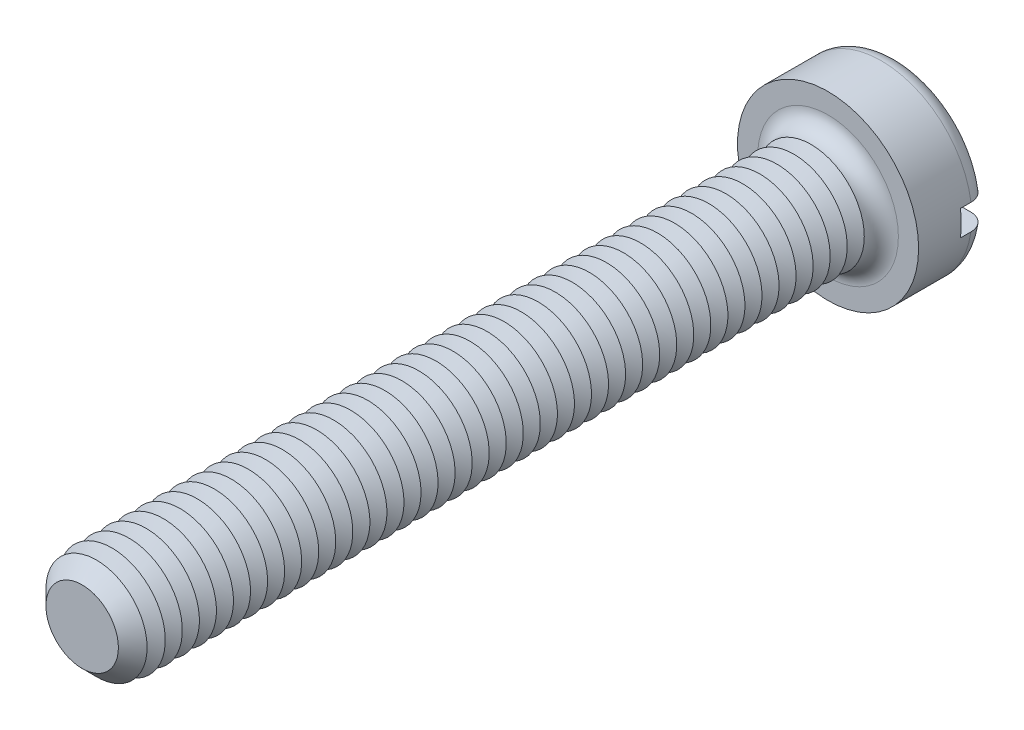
ISO-10303-21;
HEADER;
FILE_DESCRIPTION(('STEP AP214'),'2;1');
FILE_NAME('part.step','',(''),(''),'','','');
FILE_SCHEMA(('AUTOMOTIVE_DESIGN { 1 0 10303 214 1 1 1 1 }'));
ENDSEC;
DATA;
#1=APPLICATION_CONTEXT('core data for automotive mechanical design processes');
#2=APPLICATION_PROTOCOL_DEFINITION('international standard','automotive_design',2000,#1);
#3=PRODUCT_CONTEXT('',#1,'mechanical');
#4=PRODUCT('Part','Part','',(#3));
#5=PRODUCT_RELATED_PRODUCT_CATEGORY('part','',(#4));
#6=PRODUCT_DEFINITION_FORMATION('','',#4);
#7=PRODUCT_DEFINITION_CONTEXT('part definition',#1,'design');
#8=PRODUCT_DEFINITION('design','',#6,#7);
#9=PRODUCT_DEFINITION_SHAPE('','',#8);
#10=(LENGTH_UNIT() NAMED_UNIT(*) SI_UNIT(.MILLI.,.METRE.));
#11=(NAMED_UNIT(*) PLANE_ANGLE_UNIT() SI_UNIT($,.RADIAN.));
#12=(NAMED_UNIT(*) SI_UNIT($,.STERADIAN.) SOLID_ANGLE_UNIT());
#13=UNCERTAINTY_MEASURE_WITH_UNIT(LENGTH_MEASURE(1.E-05),#10,'distance_accuracy_value','');
#14=(GEOMETRIC_REPRESENTATION_CONTEXT(3) GLOBAL_UNCERTAINTY_ASSIGNED_CONTEXT((#13)) GLOBAL_UNIT_ASSIGNED_CONTEXT((#10,
#11,#12)) REPRESENTATION_CONTEXT('',''));
#15=CARTESIAN_POINT('',(0.,0.,0.));
#16=DIRECTION('',(0.,0.,1.));
#17=DIRECTION('',(1.,0.,0.));
#18=AXIS2_PLACEMENT_3D('',#15,#16,#17);
#19=CARTESIAN_POINT('',(0.,0.,-3.3));
#20=DIRECTION('',(0.,0.,1.));
#21=DIRECTION('',(1.,0.,0.));
#22=AXIS2_PLACEMENT_3D('',#19,#20,#21);
#23=PLANE('',#22);
#24=CARTESIAN_POINT('',(0.,0.,-3.3));
#25=DIRECTION('',(0.,0.,1.));
#26=DIRECTION('',(1.,0.,0.));
#27=AXIS2_PLACEMENT_3D('',#24,#25,#26);
#28=CIRCLE('',#27,3.45);
#29=CARTESIAN_POINT('',(-3.39742549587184,0.6,-3.3));
#30=VERTEX_POINT('',#29);
#31=CARTESIAN_POINT('',(3.39742549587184,0.6,-3.3));
#32=VERTEX_POINT('',#31);
#33=EDGE_CURVE('E116',#30,#32,#28,.F.);
#34=ORIENTED_EDGE('',*,*,#33,.T.);
#35=DIRECTION('',(1.,0.,0.));
#36=VECTOR('',#35,1.);
#37=CARTESIAN_POINT('',(-4.25,0.600000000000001,-3.3));
#38=LINE('',#37,#36);
#39=EDGE_CURVE('E111',#30,#32,#38,.T.);
#40=ORIENTED_EDGE('',*,*,#39,.F.);
#41=EDGE_LOOP('',(#34,#40));
#42=FACE_BOUND('',#41,.T.);
#43=ADVANCED_FACE('F39',(#42),#23,.F.);
#44=CARTESIAN_POINT('',(0.,0.,-2.5));
#45=DIRECTION('',(0.,0.,1.));
#46=DIRECTION('',(1.,0.,0.));
#47=AXIS2_PLACEMENT_3D('',#44,#45,#46);
#48=TOROIDAL_SURFACE('',#47,3.45,0.8);
#49=CARTESIAN_POINT('',(-4.06369072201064,0.600000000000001,-2.95537828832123));
#50=CARTESIAN_POINT('',(-4.03774340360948,0.600000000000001,-2.99245078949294));
#51=CARTESIAN_POINT('',(-4.00861849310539,0.600000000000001,-3.02734231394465));
#52=CARTESIAN_POINT('',(-3.94488199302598,0.600000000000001,-3.0917502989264));
#53=CARTESIAN_POINT('',(-3.91026320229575,0.600000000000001,-3.12125959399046));
#54=CARTESIAN_POINT('',(-3.83660561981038,0.600000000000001,-3.17403695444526));
#55=CARTESIAN_POINT('',(-3.79757117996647,0.6,-3.19731109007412));
#56=CARTESIAN_POINT('',(-3.71618817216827,0.6,-3.23703443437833));
#57=CARTESIAN_POINT('',(-3.67384041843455,0.6,-3.25348531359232));
#58=CARTESIAN_POINT('',(-3.58661930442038,0.6,-3.2792758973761));
#59=CARTESIAN_POINT('',(-3.54172669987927,0.6,-3.288550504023));
#60=CARTESIAN_POINT('',(-3.45102322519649,0.6,-3.29952632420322));
#61=CARTESIAN_POINT('',(-3.40521225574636,0.6,-3.30122671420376));
#62=CARTESIAN_POINT('',(-3.31340831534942,0.6,-3.29701196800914));
#63=CARTESIAN_POINT('',(-3.26741940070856,0.6,-3.29100823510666));
#64=CARTESIAN_POINT('',(-3.17708556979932,0.6,-3.27141469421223));
#65=CARTESIAN_POINT('',(-3.13274074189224,0.6,-3.25782447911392));
#66=CARTESIAN_POINT('',(-3.0466814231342,0.6,-3.22332549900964));
#67=CARTESIAN_POINT('',(-3.00498444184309,0.6,-3.20237301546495));
#68=CARTESIAN_POINT('',(-2.92572251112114,0.6,-3.15372961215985));
#69=CARTESIAN_POINT('',(-2.88815755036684,0.6,-3.12603871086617));
#70=CARTESIAN_POINT('',(-2.81847654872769,0.6,-3.06483322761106));
#71=CARTESIAN_POINT('',(-2.78633186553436,0.6,-3.03135128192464));
#72=CARTESIAN_POINT('',(-2.72824805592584,0.6,-2.95937651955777));
#73=CARTESIAN_POINT('',(-2.70230829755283,0.6,-2.92088421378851));
#74=CARTESIAN_POINT('',(-2.65791262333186,0.6,-2.84074227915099));
#75=CARTESIAN_POINT('',(-2.63932560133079,0.6,-2.79916531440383));
#76=CARTESIAN_POINT('',(-2.60958432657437,0.6,-2.7134333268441));
#77=CARTESIAN_POINT('',(-2.59842889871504,0.6,-2.66927871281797));
#78=CARTESIAN_POINT('',(-2.58411140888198,0.6,-2.58073966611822));
#79=CARTESIAN_POINT('',(-2.58077086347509,0.6,-2.5363840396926));
#80=CARTESIAN_POINT('',(-2.58167367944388,0.6,-2.44775208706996));
#81=CARTESIAN_POINT('',(-2.58591644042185,0.6,-2.40347575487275));
#82=CARTESIAN_POINT('',(-2.60175154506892,0.6,-2.31675105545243));
#83=CARTESIAN_POINT('',(-2.61326489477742,0.6,-2.27428821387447));
#84=CARTESIAN_POINT('',(-2.6431863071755,0.6,-2.19186794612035));
#85=CARTESIAN_POINT('',(-2.66159465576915,0.6,-2.15191062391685));
#86=CARTESIAN_POINT('',(-2.70494650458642,0.6,-2.07517696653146));
#87=CARTESIAN_POINT('',(-2.72995486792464,0.6,-2.03843731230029));
#88=CARTESIAN_POINT('',(-2.7856570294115,0.6,-1.96955746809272));
#89=CARTESIAN_POINT('',(-2.81635145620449,0.6,-1.93741778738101));
#90=CARTESIAN_POINT('',(-2.88329572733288,0.6,-1.87788048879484));
#91=CARTESIAN_POINT('',(-2.91965530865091,0.6,-1.85060625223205));
#92=CARTESIAN_POINT('',(-2.9963658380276,0.6,-1.80241044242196));
#93=CARTESIAN_POINT('',(-3.03671721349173,0.6,-1.78148955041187));
#94=CARTESIAN_POINT('',(-3.12111125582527,0.6,-1.74619829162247));
#95=CARTESIAN_POINT('',(-3.16521020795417,0.6,-1.73196239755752));
#96=CARTESIAN_POINT('',(-3.25516487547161,0.6,-1.71103773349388));
#97=CARTESIAN_POINT('',(-3.30102068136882,0.6,-1.70434935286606));
#98=CARTESIAN_POINT('',(-3.39352689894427,0.6,-1.69870104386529));
#99=CARTESIAN_POINT('',(-3.44018061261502,0.6,-1.69979487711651));
#100=CARTESIAN_POINT('',(-3.53263583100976,0.6,-1.70983959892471));
#101=CARTESIAN_POINT('',(-3.57843734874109,0.6,-1.71879036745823));
#102=CARTESIAN_POINT('',(-3.66763544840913,0.6,-1.74426972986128));
#103=CARTESIAN_POINT('',(-3.71104292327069,0.6,-1.76076015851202));
#104=CARTESIAN_POINT('',(-3.79442616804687,0.6,-1.80087686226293));
#105=CARTESIAN_POINT('',(-3.83440212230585,0.600000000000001,-1.82450275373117));
#106=CARTESIAN_POINT('',(-3.90929765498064,0.600000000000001,-1.87793548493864));
#107=CARTESIAN_POINT('',(-3.94426963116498,0.600000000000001,-1.90766887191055));
#108=CARTESIAN_POINT('',(-4.00864839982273,0.600000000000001,-1.9726503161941));
#109=CARTESIAN_POINT('',(-4.03805555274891,0.600000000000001,-2.00789801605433));
#110=CARTESIAN_POINT('',(-4.09009460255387,0.600000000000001,-2.08244463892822));
#111=CARTESIAN_POINT('',(-4.11280448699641,0.600000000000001,-2.12168912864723));
#112=CARTESIAN_POINT('',(-4.15124086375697,0.600000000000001,-2.2034588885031));
#113=CARTESIAN_POINT('',(-4.16696802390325,0.600000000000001,-2.24598384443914));
#114=CARTESIAN_POINT('',(-4.19085131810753,0.600000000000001,-2.33267862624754));
#115=CARTESIAN_POINT('',(-4.19907708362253,0.600000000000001,-2.37682928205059));
#116=CARTESIAN_POINT('',(-4.2079638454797,0.600000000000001,-2.46589754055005));
#117=CARTESIAN_POINT('',(-4.20862315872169,0.600000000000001,-2.51081531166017));
#118=CARTESIAN_POINT('',(-4.20236829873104,0.600000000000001,-2.59993343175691));
#119=CARTESIAN_POINT('',(-4.19548454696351,0.600000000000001,-2.64413593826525));
#120=CARTESIAN_POINT('',(-4.17439924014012,0.600000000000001,-2.73071930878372));
#121=CARTESIAN_POINT('',(-4.16020675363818,0.600000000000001,-2.77310235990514));
#122=CARTESIAN_POINT('',(-4.1318825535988,0.600000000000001,-2.83880495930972));
#123=CARTESIAN_POINT('',(-4.11991183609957,0.600000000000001,-2.86307959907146));
#124=CARTESIAN_POINT('',(-4.09356927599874,0.600000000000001,-2.91028856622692));
#125=CARTESIAN_POINT('',(-4.07919744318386,0.600000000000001,-2.9332228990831));
#126=CARTESIAN_POINT('',(-4.06369072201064,0.600000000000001,-2.95537828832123));
#127=B_SPLINE_CURVE_WITH_KNOTS('',3,(#49,#50,#51,#52,#53,#54,#55,#56,#57,#58,#59,#60,#61,#62,
#63,#64,#65,#66,#67,#68,#69,#70,#71,#72,#73,#74,#75,#76,#77,#78,#79,#80,#81,#82,#83,#84,#85,#86,
#87,#88,#89,#90,#91,#92,#93,#94,#95,#96,#97,#98,#99,#100,#101,#102,#103,#104,#105,#106,#107,
#108,#109,#110,#111,#112,#113,#114,#115,#116,#117,#118,#119,#120,#121,#122,#123,#124,#125,#126),
.UNSPECIFIED.,.T.,.F.,(4,2,2,2,2,2,2,2,2,2,2,2,2,2,2,2,2,2,2,2,2,2,2,2,2,2,2,2,2,2,2,2,2,2,2,2,
2,2,4),(0.,0.13565225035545,0.271483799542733,0.407182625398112,0.542848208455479,
0.679730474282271,0.816627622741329,0.955113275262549,1.09360635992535,1.23293614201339,
1.37226554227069,1.51083389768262,1.64938813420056,1.78534653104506,1.92128342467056,
2.0540840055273,2.18687407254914,2.31824564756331,2.44962267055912,2.58234229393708,
2.71507659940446,2.85080630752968,2.98655056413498,3.12491938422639,3.26329534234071,
3.40262816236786,3.54195885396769,3.68059194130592,3.81921757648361,3.95626453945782,
4.09330262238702,4.2286754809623,4.36403538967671,4.49812564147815,4.63224572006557,
4.76582687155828,4.89924267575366,4.98031194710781,5.0613808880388),.UNSPECIFIED.);
#128=CARTESIAN_POINT('',(-4.20743389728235,0.600000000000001,-2.50000000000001));
#129=VERTEX_POINT('',#128);
#130=EDGE_CURVE('E521',#129,#30,#127,.T.);
#131=ORIENTED_EDGE('',*,*,#130,.F.);
#132=CARTESIAN_POINT('',(0.,0.,-2.5));
#133=DIRECTION('',(0.,0.,1.));
#134=DIRECTION('',(1.,0.,0.));
#135=AXIS2_PLACEMENT_3D('',#132,#133,#134);
#136=CIRCLE('',#135,4.25);
#137=CARTESIAN_POINT('',(4.20743389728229,0.599999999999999,-2.5));
#138=VERTEX_POINT('',#137);
#139=EDGE_CURVE('E125',#138,#129,#136,.T.);
#140=ORIENTED_EDGE('',*,*,#139,.F.);
#141=CARTESIAN_POINT('',(2.63947327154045,0.6,-2.79608831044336));
#142=CARTESIAN_POINT('',(2.65655980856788,0.6,-2.83790320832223));
#143=CARTESIAN_POINT('',(2.67725642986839,0.6,-2.87828303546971));
#144=CARTESIAN_POINT('',(2.72519250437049,0.6,-2.95500233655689));
#145=CARTESIAN_POINT('',(2.75244152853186,0.6,-2.9913357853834));
#146=CARTESIAN_POINT('',(2.81257938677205,0.6,-3.05889430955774));
#147=CARTESIAN_POINT('',(2.84545995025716,0.6,-3.09012674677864));
#148=CARTESIAN_POINT('',(2.91591143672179,0.6,-3.14672620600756));
#149=CARTESIAN_POINT('',(2.95348119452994,0.6,-3.17209468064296));
#150=CARTESIAN_POINT('',(3.03291143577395,0.6,-3.21669611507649));
#151=CARTESIAN_POINT('',(3.07483186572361,0.6,-3.23582234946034));
#152=CARTESIAN_POINT('',(3.16126659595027,0.6,-3.26686062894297));
#153=CARTESIAN_POINT('',(3.2057811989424,0.6,-3.27877183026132));
#154=CARTESIAN_POINT('',(3.29669878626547,0.6,-3.29514603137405));
#155=CARTESIAN_POINT('',(3.34311773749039,0.6,-3.29952056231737));
#156=CARTESIAN_POINT('',(3.43603189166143,0.6,-3.30040472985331));
#157=CARTESIAN_POINT('',(3.48252709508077,0.6,-3.29691431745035));
#158=CARTESIAN_POINT('',(3.57420049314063,0.6,-3.28214240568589));
#159=CARTESIAN_POINT('',(3.61938038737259,0.6,-3.27087147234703));
#160=CARTESIAN_POINT('',(3.70717477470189,0.6,-3.24082890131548));
#161=CARTESIAN_POINT('',(3.74978938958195,0.6,-3.22205762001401));
#162=CARTESIAN_POINT('',(3.83078828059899,0.6,-3.17773607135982));
#163=CARTESIAN_POINT('',(3.86921015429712,0.599999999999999,-3.15225453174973));
#164=CARTESIAN_POINT('',(3.94116038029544,0.599999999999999,-3.09512672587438));
#165=CARTESIAN_POINT('',(3.9746890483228,0.599999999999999,-3.06348085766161));
#166=CARTESIAN_POINT('',(4.03545911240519,0.599999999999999,-2.99534640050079));
#167=CARTESIAN_POINT('',(4.06277344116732,0.599999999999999,-2.95892285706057));
#168=CARTESIAN_POINT('',(4.11082191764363,0.599999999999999,-2.88196698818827));
#169=CARTESIAN_POINT('',(4.13155647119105,0.599999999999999,-2.84143491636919));
#170=CARTESIAN_POINT('',(4.16563480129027,0.599999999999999,-2.75787550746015));
#171=CARTESIAN_POINT('',(4.1790544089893,0.599999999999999,-2.71487908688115));
#172=CARTESIAN_POINT('',(4.19843340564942,0.599999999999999,-2.62723691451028));
#173=CARTESIAN_POINT('',(4.20439310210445,0.599999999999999,-2.58259123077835));
#174=CARTESIAN_POINT('',(4.2086595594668,0.599999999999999,-2.49321831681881));
#175=CARTESIAN_POINT('',(4.20701422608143,0.599999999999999,-2.4484933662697));
#176=CARTESIAN_POINT('',(4.1962295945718,0.599999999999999,-2.35995704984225));
#177=CARTESIAN_POINT('',(4.18709040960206,0.599999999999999,-2.31614567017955));
#178=CARTESIAN_POINT('',(4.16160290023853,0.599999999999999,-2.23072100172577));
#179=CARTESIAN_POINT('',(4.14526169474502,0.599999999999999,-2.18910558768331));
#180=CARTESIAN_POINT('',(4.10585410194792,0.599999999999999,-2.10919238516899));
#181=CARTESIAN_POINT('',(4.08278762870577,0.599999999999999,-2.07089463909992));
#182=CARTESIAN_POINT('',(4.030487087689,0.599999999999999,-1.99851484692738));
#183=CARTESIAN_POINT('',(4.00122628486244,0.599999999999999,-1.9644521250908));
#184=CARTESIAN_POINT('',(3.93744772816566,0.599999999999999,-1.90166877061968));
#185=CARTESIAN_POINT('',(3.90292977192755,0.599999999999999,-1.87294834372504));
#186=CARTESIAN_POINT('',(3.82928727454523,0.599999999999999,-1.82137853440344));
#187=CARTESIAN_POINT('',(3.79012374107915,0.6,-1.79858484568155));
#188=CARTESIAN_POINT('',(3.70856025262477,0.6,-1.75980712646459));
#189=CARTESIAN_POINT('',(3.66616010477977,0.6,-1.74382350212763));
#190=CARTESIAN_POINT('',(3.57878495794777,0.6,-1.71891499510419));
#191=CARTESIAN_POINT('',(3.53378519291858,0.6,-1.71007699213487));
#192=CARTESIAN_POINT('',(3.44294322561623,0.6,-1.69998722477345));
#193=CARTESIAN_POINT('',(3.3971009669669,0.6,-1.69873596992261));
#194=CARTESIAN_POINT('',(3.30531297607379,0.6,-1.70385439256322));
#195=CARTESIAN_POINT('',(3.25937213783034,0.6,-1.71031204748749));
#196=CARTESIAN_POINT('',(3.1692099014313,0.6,-1.73080107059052));
#197=CARTESIAN_POINT('',(3.12498860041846,0.6,-1.74483286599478));
#198=CARTESIAN_POINT('',(3.03926209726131,0.6,-1.78018941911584));
#199=CARTESIAN_POINT('',(2.99777407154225,0.6,-1.80155586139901));
#200=CARTESIAN_POINT('',(2.91899881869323,0.6,-1.85098881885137));
#201=CARTESIAN_POINT('',(2.88171158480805,0.6,-1.8790553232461));
#202=CARTESIAN_POINT('',(2.81266124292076,0.6,-1.94094884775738));
#203=CARTESIAN_POINT('',(2.78086710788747,0.6,-1.97474122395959));
#204=CARTESIAN_POINT('',(2.72353615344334,0.6,-2.0472724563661));
#205=CARTESIAN_POINT('',(2.69799841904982,0.6,-2.08601058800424));
#206=CARTESIAN_POINT('',(2.65444718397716,0.6,-2.16655019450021));
#207=CARTESIAN_POINT('',(2.63629889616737,0.6,-2.20827875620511));
#208=CARTESIAN_POINT('',(2.60744942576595,0.6,-2.29424821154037));
#209=CARTESIAN_POINT('',(2.59674901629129,0.6,-2.33848936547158));
#210=CARTESIAN_POINT('',(2.5833312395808,0.6,-2.42714258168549));
#211=CARTESIAN_POINT('',(2.58043995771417,0.6,-2.47152848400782));
#212=CARTESIAN_POINT('',(2.58224493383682,0.6,-2.56010574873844));
#213=CARTESIAN_POINT('',(2.58693104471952,0.6,-2.60429729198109));
#214=CARTESIAN_POINT('',(2.60020046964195,0.6,-2.67311978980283));
#215=CARTESIAN_POINT('',(2.60635343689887,0.6,-2.69824441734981));
#216=CARTESIAN_POINT('',(2.62110140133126,0.6,-2.74776540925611));
#217=CARTESIAN_POINT('',(2.62969634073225,0.6,-2.77216179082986));
#218=CARTESIAN_POINT('',(2.63947327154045,0.6,-2.79608831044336));
#219=B_SPLINE_CURVE_WITH_KNOTS('',3,(#141,#142,#143,#144,#145,#146,#147,#148,#149,#150,#151,
#152,#153,#154,#155,#156,#157,#158,#159,#160,#161,#162,#163,#164,#165,#166,#167,#168,#169,#170,
#171,#172,#173,#174,#175,#176,#177,#178,#179,#180,#181,#182,#183,#184,#185,#186,#187,#188,#189,
#190,#191,#192,#193,#194,#195,#196,#197,#198,#199,#200,#201,#202,#203,#204,#205,#206,#207,#208,
#209,#210,#211,#212,#213,#214,#215,#216,#217,#218),.UNSPECIFIED.,.T.,.F.,(4,2,2,2,2,2,2,2,2,2,2,
2,2,2,2,2,2,2,2,2,2,2,2,2,2,2,2,2,2,2,2,2,2,2,2,2,2,2,4),(0.,0.135416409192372,
0.271031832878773,0.406449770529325,0.541834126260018,0.679424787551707,0.817031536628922,
0.956242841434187,1.09545501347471,1.23447850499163,1.37349539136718,1.51114036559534,
1.64877645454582,1.78470267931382,1.92062051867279,2.05510117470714,2.1895762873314,
2.32320547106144,2.45683263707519,2.59032801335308,2.72382509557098,2.85791055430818,
2.99200117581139,3.12730969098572,3.26262627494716,3.39956435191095,3.53651162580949,
3.67503685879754,3.81356990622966,3.95290367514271,4.09223721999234,4.23075602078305,
4.36925455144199,4.50509949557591,4.6409585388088,4.77376594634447,4.90639565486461,
4.98388287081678,5.06136825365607),.UNSPECIFIED.);
#220=EDGE_CURVE('E523',#32,#138,#219,.T.);
#221=ORIENTED_EDGE('',*,*,#220,.F.);
#222=ORIENTED_EDGE('',*,*,#33,.F.);
#223=EDGE_LOOP('',(#131,#140,#221,#222));
#224=FACE_BOUND('',#223,.T.);
#225=ADVANCED_FACE('F505',(#224),#48,.T.);
#226=CARTESIAN_POINT('',(0.,0.,-3.3));
#227=DIRECTION('',(0.,0.,1.));
#228=DIRECTION('',(1.,0.,0.));
#229=AXIS2_PLACEMENT_3D('',#226,#227,#228);
#230=CYLINDRICAL_SURFACE('',#229,4.25);
#231=DIRECTION('',(0.,0.,1.));
#232=VECTOR('',#231,1.);
#233=CARTESIAN_POINT('',(4.20743389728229,0.599999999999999,-3.3));
#234=LINE('',#233,#232);
#235=CARTESIAN_POINT('',(4.20743389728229,0.599999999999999,-2.));
#236=VERTEX_POINT('',#235);
#237=EDGE_CURVE('E537',#138,#236,#234,.T.);
#238=ORIENTED_EDGE('',*,*,#237,.F.);
#239=ORIENTED_EDGE('',*,*,#139,.T.);
#240=DIRECTION('',(0.,0.,1.));
#241=VECTOR('',#240,1.);
#242=CARTESIAN_POINT('',(-4.20743389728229,0.600000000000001,-3.3));
#243=LINE('',#242,#241);
#244=CARTESIAN_POINT('',(-4.20743389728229,0.600000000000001,-2.));
#245=VERTEX_POINT('',#244);
#246=EDGE_CURVE('E63',#245,#129,#243,.F.);
#247=ORIENTED_EDGE('',*,*,#246,.F.);
#248=CARTESIAN_POINT('',(0.,0.,-2.));
#249=DIRECTION('',(0.,0.,-1.));
#250=DIRECTION('',(-1.,0.,0.));
#251=AXIS2_PLACEMENT_3D('',#248,#249,#250);
#252=CIRCLE('',#251,4.25);
#253=CARTESIAN_POINT('',(-4.20743389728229,-0.599999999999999,-2.));
#254=VERTEX_POINT('',#253);
#255=EDGE_CURVE('E43',#245,#254,#252,.F.);
#256=ORIENTED_EDGE('',*,*,#255,.T.);
#257=DIRECTION('',(0.,0.,1.));
#258=VECTOR('',#257,1.);
#259=CARTESIAN_POINT('',(-4.20743389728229,-0.599999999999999,-3.3));
#260=LINE('',#259,#258);
#261=CARTESIAN_POINT('',(-4.20743389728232,-0.599999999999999,-2.5));
#262=VERTEX_POINT('',#261);
#263=EDGE_CURVE('E534',#262,#254,#260,.T.);
#264=ORIENTED_EDGE('',*,*,#263,.F.);
#265=CARTESIAN_POINT('',(4.20743389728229,-0.600000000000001,-2.5));
#266=VERTEX_POINT('',#265);
#267=EDGE_CURVE('E127',#262,#266,#136,.T.);
#268=ORIENTED_EDGE('',*,*,#267,.T.);
#269=DIRECTION('',(0.,0.,1.));
#270=VECTOR('',#269,1.);
#271=CARTESIAN_POINT('',(4.20743389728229,-0.600000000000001,-3.3));
#272=LINE('',#271,#270);
#273=CARTESIAN_POINT('',(4.20743389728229,-0.600000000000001,-2.));
#274=VERTEX_POINT('',#273);
#275=EDGE_CURVE('E55',#274,#266,#272,.F.);
#276=ORIENTED_EDGE('',*,*,#275,.F.);
#277=EDGE_CURVE('E11',#274,#236,#252,.F.);
#278=ORIENTED_EDGE('',*,*,#277,.T.);
#279=EDGE_LOOP('',(#238,#239,#247,#256,#264,#268,#276,#278));
#280=FACE_BOUND('',#279,.T.);
#281=CARTESIAN_POINT('',(0.,0.,0.));
#282=DIRECTION('',(0.,0.,1.));
#283=DIRECTION('',(1.,0.,0.));
#284=AXIS2_PLACEMENT_3D('',#281,#282,#283);
#285=CIRCLE('',#284,4.25);
#286=CARTESIAN_POINT('',(4.25,0.,0.));
#287=VERTEX_POINT('',#286);
#288=EDGE_CURVE('E540',#287,#287,#285,.T.);
#289=ORIENTED_EDGE('',*,*,#288,.F.);
#290=EDGE_LOOP('',(#289));
#291=FACE_BOUND('',#290,.T.);
#292=ADVANCED_FACE('F501',(#280,#291),#230,.T.);
#293=CARTESIAN_POINT('',(3.39742549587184,-0.6,-3.3));
#294=VERTEX_POINT('',#293);
#295=CARTESIAN_POINT('',(-3.39742549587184,-0.6,-3.3));
#296=VERTEX_POINT('',#295);
#297=EDGE_CURVE('E109',#294,#296,#28,.F.);
#298=ORIENTED_EDGE('',*,*,#297,.T.);
#299=DIRECTION('',(-1.,0.,0.));
#300=VECTOR('',#299,1.);
#301=CARTESIAN_POINT('',(-4.25,-0.599999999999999,-3.3));
#302=LINE('',#301,#300);
#303=EDGE_CURVE('E96',#294,#296,#302,.T.);
#304=ORIENTED_EDGE('',*,*,#303,.F.);
#305=EDGE_LOOP('',(#298,#304));
#306=FACE_BOUND('',#305,.T.);
#307=ADVANCED_FACE('F108',(#306),#23,.F.);
#308=CARTESIAN_POINT('',(0.,0.,0.));
#309=DIRECTION('',(0.,0.,1.));
#310=DIRECTION('',(1.,0.,0.));
#311=AXIS2_PLACEMENT_3D('',#308,#309,#310);
#312=PLANE('',#311);
#313=CARTESIAN_POINT('',(0.,0.,0.));
#314=DIRECTION('',(0.,0.,1.));
#315=DIRECTION('',(1.,0.,0.));
#316=AXIS2_PLACEMENT_3D('',#313,#314,#315);
#317=CIRCLE('',#316,3.3);
#318=CARTESIAN_POINT('',(3.3,0.,0.));
#319=VERTEX_POINT('',#318);
#320=EDGE_CURVE('E115',#319,#319,#317,.F.);
#321=ORIENTED_EDGE('',*,*,#320,.T.);
#322=EDGE_LOOP('',(#321));
#323=FACE_BOUND('',#322,.T.);
#324=ORIENTED_EDGE('',*,*,#288,.T.);
#325=EDGE_LOOP('',(#324));
#326=FACE_BOUND('',#325,.T.);
#327=ADVANCED_FACE('F500',(#323,#326),#312,.T.);
#328=CARTESIAN_POINT('',(-4.06369072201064,-0.599999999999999,-2.95537828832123));
#329=CARTESIAN_POINT('',(-4.08928577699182,-0.599999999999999,-2.91880204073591));
#330=CARTESIAN_POINT('',(-4.11182555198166,-0.599999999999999,-2.88005030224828));
#331=CARTESIAN_POINT('',(-4.15010404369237,-0.599999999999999,-2.79928452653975));
#332=CARTESIAN_POINT('',(-4.16583526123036,-0.599999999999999,-2.75726695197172));
#333=CARTESIAN_POINT('',(-4.19000286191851,-0.599999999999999,-2.67118996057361));
#334=CARTESIAN_POINT('',(-4.19844101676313,-0.599999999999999,-2.62713104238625));
#335=CARTESIAN_POINT('',(-4.20777174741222,-0.599999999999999,-2.53823222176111));
#336=CARTESIAN_POINT('',(-4.20866608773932,-0.599999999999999,-2.49339250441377));
#337=CARTESIAN_POINT('',(-4.20289683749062,-0.599999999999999,-2.40433856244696));
#338=CARTESIAN_POINT('',(-4.19625607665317,-0.599999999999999,-2.36012285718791));
#339=CARTESIAN_POINT('',(-4.17565084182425,-0.599999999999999,-2.27343166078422));
#340=CARTESIAN_POINT('',(-4.16168615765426,-0.599999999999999,-2.23095621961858));
#341=CARTESIAN_POINT('',(-4.12683188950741,-0.599999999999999,-2.14890863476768));
#342=CARTESIAN_POINT('',(-4.10593663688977,-0.599999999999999,-2.10933890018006));
#343=CARTESIAN_POINT('',(-4.05783763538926,-0.599999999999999,-2.03424145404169));
#344=CARTESIAN_POINT('',(-4.03063375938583,-0.599999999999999,-1.99871382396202));
#345=CARTESIAN_POINT('',(-3.97052236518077,-0.599999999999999,-1.93246905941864));
#346=CARTESIAN_POINT('',(-3.93758114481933,-0.599999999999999,-1.90178251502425));
#347=CARTESIAN_POINT('',(-3.86706007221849,-0.599999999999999,-1.84630837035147));
#348=CARTESIAN_POINT('',(-3.82948001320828,-0.6,-1.82152103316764));
#349=CARTESIAN_POINT('',(-3.75033766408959,-0.6,-1.77826995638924));
#350=CARTESIAN_POINT('',(-3.70873831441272,-0.6,-1.7598740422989));
#351=CARTESIAN_POINT('',(-3.62306661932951,-0.6,-1.73023196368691));
#352=CARTESIAN_POINT('',(-3.57899411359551,-0.6,-1.71898626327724));
#353=CARTESIAN_POINT('',(-3.48904845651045,-0.6,-1.70382025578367));
#354=CARTESIAN_POINT('',(-3.44315982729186,-0.6,-1.69999172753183));
#355=CARTESIAN_POINT('',(-3.35138360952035,-0.6,-1.7000083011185));
#356=CARTESIAN_POINT('',(-3.30549602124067,-0.6,-1.70385391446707));
#357=CARTESIAN_POINT('',(-3.21452492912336,-0.6,-1.71917227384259));
#358=CARTESIAN_POINT('',(-3.16945455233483,-0.6,-1.73072307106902));
#359=CARTESIAN_POINT('',(-3.08188104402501,-0.6,-1.76120640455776));
#360=CARTESIAN_POINT('',(-3.0393780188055,-0.6,-1.78013924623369));
#361=CARTESIAN_POINT('',(-2.95805296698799,-0.6,-1.82493384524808));
#362=CARTESIAN_POINT('',(-2.9192403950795,-0.6,-1.85081278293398));
#363=CARTESIAN_POINT('',(-2.84656695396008,-0.6,-1.90878317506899));
#364=CARTESIAN_POINT('',(-2.81270591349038,-0.6,-1.94087441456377));
#365=CARTESIAN_POINT('',(-2.75131050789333,-0.6,-2.01002500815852));
#366=CARTESIAN_POINT('',(-2.72371339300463,-0.6,-2.04702860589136));
#367=CARTESIAN_POINT('',(-2.67528742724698,-0.6,-2.12522869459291));
#368=CARTESIAN_POINT('',(-2.65445765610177,-0.6,-2.1664246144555));
#369=CARTESIAN_POINT('',(-2.62065354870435,-0.6,-2.25087266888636));
#370=CARTESIAN_POINT('',(-2.60751663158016,-0.6,-2.29405971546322));
#371=CARTESIAN_POINT('',(-2.58885106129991,-0.6,-2.38204659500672));
#372=CARTESIAN_POINT('',(-2.58332131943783,-0.6,-2.42684619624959));
#373=CARTESIAN_POINT('',(-2.58009777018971,-0.6,-2.51580379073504));
#374=CARTESIAN_POINT('',(-2.58224575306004,-0.6,-2.55995612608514));
#375=CARTESIAN_POINT('',(-2.59395205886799,-0.6,-2.64726495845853));
#376=CARTESIAN_POINT('',(-2.60351013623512,-0.6,-2.69042148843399));
#377=CARTESIAN_POINT('',(-2.62967159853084,-0.6,-2.77438771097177));
#378=CARTESIAN_POINT('',(-2.64625243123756,-0.6,-2.81520444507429));
#379=CARTESIAN_POINT('',(-2.68592348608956,-0.6,-2.89353901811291));
#380=CARTESIAN_POINT('',(-2.70901418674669,-0.6,-2.9310566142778));
#381=CARTESIAN_POINT('',(-2.7614318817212,-0.6,-3.00240040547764));
#382=CARTESIAN_POINT('',(-2.79085487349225,-0.6,-3.03615603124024));
#383=CARTESIAN_POINT('',(-2.85483456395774,-0.6,-3.09838834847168));
#384=CARTESIAN_POINT('',(-2.88939187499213,-0.6,-3.12686440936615));
#385=CARTESIAN_POINT('',(-2.96351967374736,-0.6,-3.17841283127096));
#386=CARTESIAN_POINT('',(-3.00318741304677,-0.6,-3.20134539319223));
#387=CARTESIAN_POINT('',(-3.08576649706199,-0.6,-3.24034364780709));
#388=CARTESIAN_POINT('',(-3.12867814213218,-0.6,-3.25640870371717));
#389=CARTESIAN_POINT('',(-3.21724048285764,-0.6,-3.28143816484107));
#390=CARTESIAN_POINT('',(-3.26292314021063,-0.6,-3.29028963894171));
#391=CARTESIAN_POINT('',(-3.35512527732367,-0.6,-3.30021681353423));
#392=CARTESIAN_POINT('',(-3.40164474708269,-0.6,-3.30129260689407));
#393=CARTESIAN_POINT('',(-3.49429978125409,-0.6,-3.29560589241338));
#394=CARTESIAN_POINT('',(-3.54043436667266,-0.6,-3.28882735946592));
#395=CARTESIAN_POINT('',(-3.63090382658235,-0.6,-3.26755492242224));
#396=CARTESIAN_POINT('',(-3.67523831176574,-0.6,-3.25305935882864));
#397=CARTESIAN_POINT('',(-3.76046509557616,-0.6,-3.21686867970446));
#398=CARTESIAN_POINT('',(-3.80138087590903,-0.599999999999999,-3.1952288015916));
#399=CARTESIAN_POINT('',(-3.8788986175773,-0.599999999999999,-3.14531817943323));
#400=CARTESIAN_POINT('',(-3.91550599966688,-0.599999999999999,-3.11705590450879));
#401=CARTESIAN_POINT('',(-3.97074313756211,-0.599999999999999,-3.06628809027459));
#402=CARTESIAN_POINT('',(-3.99100743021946,-0.599999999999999,-3.04553102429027));
#403=CARTESIAN_POINT('',(-4.02917385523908,-0.599999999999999,-3.00194762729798));
#404=CARTESIAN_POINT('',(-4.04707600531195,-0.599999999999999,-2.97912131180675));
#405=CARTESIAN_POINT('',(-4.06369072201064,-0.599999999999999,-2.95537828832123));
#406=B_SPLINE_CURVE_WITH_KNOTS('',3,(#328,#329,#330,#331,#332,#333,#334,#335,#336,#337,#338,
#339,#340,#341,#342,#343,#344,#345,#346,#347,#348,#349,#350,#351,#352,#353,#354,#355,#356,#357,
#358,#359,#360,#361,#362,#363,#364,#365,#366,#367,#368,#369,#370,#371,#372,#373,#374,#375,#376,
#377,#378,#379,#380,#381,#382,#383,#384,#385,#386,#387,#388,#389,#390,#391,#392,#393,#394,#395,
#396,#397,#398,#399,#400,#401,#402,#403,#404,#405),.UNSPECIFIED.,.T.,.F.,(4,2,2,2,2,2,2,2,2,2,2,
2,2,2,2,2,2,2,2,2,2,2,2,2,2,2,2,2,2,2,2,2,2,2,2,2,2,2,4),(0.,0.133821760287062,
0.267790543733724,0.401726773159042,0.535631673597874,0.669131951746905,0.802636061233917,
0.936249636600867,1.06986590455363,1.2042952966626,1.3387306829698,1.47455198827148,
1.61038210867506,1.74788249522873,1.88539204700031,2.02431612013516,2.16324594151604,
2.30252260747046,2.4417944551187,2.57960263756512,2.71739207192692,2.85215325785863,
2.98689515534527,3.11887666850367,3.25085380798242,3.38241030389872,3.51397647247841,
3.64769871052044,3.78143690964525,3.91826005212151,4.05509587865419,4.19403485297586,
4.33297216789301,4.47219345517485,4.61144469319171,4.74964356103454,4.887666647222,
4.97453605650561,5.06140481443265),.UNSPECIFIED.);
#407=EDGE_CURVE('E103',#296,#262,#406,.T.);
#408=ORIENTED_EDGE('',*,*,#407,.F.);
#409=ORIENTED_EDGE('',*,*,#297,.F.);
#410=CARTESIAN_POINT('',(2.63947327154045,-0.6,-2.79608831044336));
#411=CARTESIAN_POINT('',(2.62285766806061,-0.6,-2.75541510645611));
#412=CARTESIAN_POINT('',(2.60963282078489,-0.6,-2.71332585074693));
#413=CARTESIAN_POINT('',(2.59042394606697,-0.6,-2.62749460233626));
#414=CARTESIAN_POINT('',(2.58444686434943,-0.6,-2.58375106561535));
#415=CARTESIAN_POINT('',(2.57995287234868,-0.6,-2.49588524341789));
#416=CARTESIAN_POINT('',(2.58143477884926,-0.6,-2.45176301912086));
#417=CARTESIAN_POINT('',(2.59180622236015,-0.6,-2.36440906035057));
#418=CARTESIAN_POINT('',(2.60069434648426,-0.6,-2.32117715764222));
#419=CARTESIAN_POINT('',(2.62554964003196,-0.6,-2.23689909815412));
#420=CARTESIAN_POINT('',(2.6415022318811,-0.6,-2.19584863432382));
#421=CARTESIAN_POINT('',(2.67996913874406,-0.6,-2.11694797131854));
#422=CARTESIAN_POINT('',(2.70248409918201,-0.6,-2.07909808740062));
#423=CARTESIAN_POINT('',(2.75378972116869,-0.6,-2.00702296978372));
#424=CARTESIAN_POINT('',(2.7826732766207,-0.6,-1.97286389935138));
#425=CARTESIAN_POINT('',(2.84564717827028,-0.6,-1.90974167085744));
#426=CARTESIAN_POINT('',(2.87973812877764,-0.6,-1.88077911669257));
#427=CARTESIAN_POINT('',(2.95300941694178,-0.6,-1.82817307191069));
#428=CARTESIAN_POINT('',(2.99228920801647,-0.6,-1.8046680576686));
#429=CARTESIAN_POINT('',(3.07419050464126,-0.6,-1.76446470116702));
#430=CARTESIAN_POINT('',(3.11681231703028,-0.6,-1.74776698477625));
#431=CARTESIAN_POINT('',(3.20492149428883,-0.6,-1.72140945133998));
#432=CARTESIAN_POINT('',(3.25044365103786,-0.6,-1.71186578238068));
#433=CARTESIAN_POINT('',(3.34244451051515,-0.6,-1.70053183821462));
#434=CARTESIAN_POINT('',(3.38892324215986,-0.6,-1.69874179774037));
#435=CARTESIAN_POINT('',(3.48165030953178,-0.6,-1.70299737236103));
#436=CARTESIAN_POINT('',(3.52789766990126,-0.6,-1.70906439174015));
#437=CARTESIAN_POINT('',(3.61869999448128,-0.6,-1.72893768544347));
#438=CARTESIAN_POINT('',(3.6632550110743,-0.6,-1.742743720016));
#439=CARTESIAN_POINT('',(3.7490339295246,-0.6,-1.77760539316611));
#440=CARTESIAN_POINT('',(3.79028083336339,-0.600000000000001,-1.79860440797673));
#441=CARTESIAN_POINT('',(3.86860401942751,-0.600000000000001,-1.84731105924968));
#442=CARTESIAN_POINT('',(3.90568056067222,-0.600000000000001,-1.87501827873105));
#443=CARTESIAN_POINT('',(3.97412845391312,-0.600000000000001,-1.93599408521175));
#444=CARTESIAN_POINT('',(4.00556369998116,-0.600000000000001,-1.96919094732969));
#445=CARTESIAN_POINT('',(4.06233546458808,-0.600000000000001,-2.0404445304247));
#446=CARTESIAN_POINT('',(4.08767237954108,-0.600000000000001,-2.07850093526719));
#447=CARTESIAN_POINT('',(4.13122502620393,-0.600000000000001,-2.15791791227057));
#448=CARTESIAN_POINT('',(4.14951966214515,-0.600000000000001,-2.19923522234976));
#449=CARTESIAN_POINT('',(4.17884974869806,-0.600000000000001,-2.28437065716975));
#450=CARTESIAN_POINT('',(4.18988555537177,-0.600000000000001,-2.32818865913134));
#451=CARTESIAN_POINT('',(4.20430724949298,-0.600000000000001,-2.41670951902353));
#452=CARTESIAN_POINT('',(4.2077528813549,-0.600000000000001,-2.46140265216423));
#453=CARTESIAN_POINT('',(4.20706844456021,-0.600000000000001,-2.55073028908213));
#454=CARTESIAN_POINT('',(4.20293856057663,-0.600000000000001,-2.595364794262));
#455=CARTESIAN_POINT('',(4.18724926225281,-0.600000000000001,-2.68317733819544));
#456=CARTESIAN_POINT('',(4.17571081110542,-0.600000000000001,-2.72635912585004));
#457=CARTESIAN_POINT('',(4.14556645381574,-0.600000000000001,-2.81017999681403));
#458=CARTESIAN_POINT('',(4.12696052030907,-0.600000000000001,-2.85081907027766));
#459=CARTESIAN_POINT('',(4.08317014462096,-0.600000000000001,-2.92852328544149));
#460=CARTESIAN_POINT('',(4.0579684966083,-0.600000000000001,-2.96557872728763));
#461=CARTESIAN_POINT('',(4.00174565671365,-0.600000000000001,-3.034972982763));
#462=CARTESIAN_POINT('',(3.97072429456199,-0.600000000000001,-3.06731165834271));
#463=CARTESIAN_POINT('',(3.90349659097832,-0.600000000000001,-3.12662735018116));
#464=CARTESIAN_POINT('',(3.86725240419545,-0.600000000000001,-3.15356146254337));
#465=CARTESIAN_POINT('',(3.79079809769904,-0.600000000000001,-3.20104156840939));
#466=CARTESIAN_POINT('',(3.75058775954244,-0.6,-3.22158720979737));
#467=CARTESIAN_POINT('',(3.6668595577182,-0.6,-3.25595832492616));
#468=CARTESIAN_POINT('',(3.62330947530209,-0.6,-3.26970530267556));
#469=CARTESIAN_POINT('',(3.53453348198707,-0.6,-3.28979004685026));
#470=CARTESIAN_POINT('',(3.48930745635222,-0.6,-3.29612730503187));
#471=CARTESIAN_POINT('',(3.39787506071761,-0.6,-3.30128612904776));
#472=CARTESIAN_POINT('',(3.35166346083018,-0.6,-3.30001513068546));
#473=CARTESIAN_POINT('',(3.26009663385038,-0.6,-3.28980210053));
#474=CARTESIAN_POINT('',(3.21474142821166,-0.6,-3.28085987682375));
#475=CARTESIAN_POINT('',(3.12577990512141,-0.6,-3.2554540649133));
#476=CARTESIAN_POINT('',(3.08219120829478,-0.6,-3.23892872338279));
#477=CARTESIAN_POINT('',(2.99839730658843,-0.6,-3.1987810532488));
#478=CARTESIAN_POINT('',(2.95819301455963,-0.6,-3.17515681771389));
#479=CARTESIAN_POINT('',(2.88239372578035,-0.6,-3.12147666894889));
#480=CARTESIAN_POINT('',(2.84679445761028,-0.6,-3.09142678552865));
#481=CARTESIAN_POINT('',(2.78127483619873,-0.6,-3.02571584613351));
#482=CARTESIAN_POINT('',(2.75134725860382,-0.6,-2.99006203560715));
#483=CARTESIAN_POINT('',(2.70767232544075,-0.6,-2.92780516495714));
#484=CARTESIAN_POINT('',(2.69197340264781,-0.6,-2.90254809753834));
#485=CARTESIAN_POINT('',(2.66349078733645,-0.6,-2.8504392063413));
#486=CARTESIAN_POINT('',(2.65070705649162,-0.6,-2.82358740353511));
#487=CARTESIAN_POINT('',(2.63947327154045,-0.6,-2.79608831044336));
#488=B_SPLINE_CURVE_WITH_KNOTS('',3,(#410,#411,#412,#413,#414,#415,#416,#417,#418,#419,#420,
#421,#422,#423,#424,#425,#426,#427,#428,#429,#430,#431,#432,#433,#434,#435,#436,#437,#438,#439,
#440,#441,#442,#443,#444,#445,#446,#447,#448,#449,#450,#451,#452,#453,#454,#455,#456,#457,#458,
#459,#460,#461,#462,#463,#464,#465,#466,#467,#468,#469,#470,#471,#472,#473,#474,#475,#476,#477,
#478,#479,#480,#481,#482,#483,#484,#485,#486,#487),.UNSPECIFIED.,.T.,.F.,(4,2,2,2,2,2,2,2,2,2,2,
2,2,2,2,2,2,2,2,2,2,2,2,2,2,2,2,2,2,2,2,2,2,2,2,2,2,2,4),(0.,0.131701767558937,
0.263529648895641,0.395336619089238,0.527118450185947,0.658629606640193,0.790153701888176,
0.923740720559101,1.05734325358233,1.19403504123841,1.33073939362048,1.46961778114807,
1.60850037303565,1.74776210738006,1.88701952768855,2.02520497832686,2.16338184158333,
2.29987843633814,2.43636615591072,2.57127672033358,2.7061806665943,2.84001889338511,
2.97385385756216,3.1073117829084,3.24077022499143,3.37458034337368,3.50839437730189,
3.64323196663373,3.77807698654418,3.91444452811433,4.05082142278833,4.18886086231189,
4.32690375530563,4.46609131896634,4.60531630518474,4.74441121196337,4.88332773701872,
4.97237227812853,5.06141564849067),.UNSPECIFIED.);
#489=EDGE_CURVE('E92',#266,#294,#488,.T.);
#490=ORIENTED_EDGE('',*,*,#489,.F.);
#491=ORIENTED_EDGE('',*,*,#267,.F.);
#492=EDGE_LOOP('',(#408,#409,#490,#491));
#493=FACE_BOUND('',#492,.T.);
#494=ADVANCED_FACE('F113',(#493),#48,.T.);
#495=CARTESIAN_POINT('',(0.,0.,0.800000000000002));
#496=DIRECTION('',(0.,0.,1.));
#497=DIRECTION('',(1.,0.,0.));
#498=AXIS2_PLACEMENT_3D('',#495,#496,#497);
#499=TOROIDAL_SURFACE('',#498,3.3,0.8);
#500=ORIENTED_EDGE('',*,*,#320,.F.);
#501=EDGE_LOOP('',(#500));
#502=FACE_BOUND('',#501,.T.);
#503=CARTESIAN_POINT('',(0.,0.,0.799999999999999));
#504=DIRECTION('',(0.,0.,-1.));
#505=DIRECTION('',(-1.,0.,0.));
#506=AXIS2_PLACEMENT_3D('',#503,#504,#505);
#507=CIRCLE('',#506,2.5);
#508=CARTESIAN_POINT('',(-2.5,0.,0.799999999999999));
#509=VERTEX_POINT('',#508);
#510=EDGE_CURVE('E545',#509,#509,#507,.T.);
#511=ORIENTED_EDGE('',*,*,#510,.T.);
#512=EDGE_LOOP('',(#511));
#513=FACE_BOUND('',#512,.T.);
#514=ADVANCED_FACE('F493',(#502,#513),#499,.F.);
#515=CARTESIAN_POINT('',(0.,0.,1.2));
#516=DIRECTION('',(0.,0.,-1.));
#517=DIRECTION('',(-1.,0.,0.));
#518=AXIS2_PLACEMENT_3D('',#515,#516,#517);
#519=CONICAL_SURFACE('',#518,1.80717967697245,1.0471975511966);
#520=ORIENTED_EDGE('',*,*,#510,.F.);
#521=EDGE_LOOP('',(#520));
#522=FACE_BOUND('',#521,.T.);
#523=CARTESIAN_POINT('',(0.,0.,1.2));
#524=DIRECTION('',(0.,0.,-1.));
#525=DIRECTION('',(-1.,0.,0.));
#526=AXIS2_PLACEMENT_3D('',#523,#524,#525);
#527=CIRCLE('',#526,1.80717967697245);
#528=CARTESIAN_POINT('',(-1.80717967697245,0.,1.2));
#529=VERTEX_POINT('',#528);
#530=EDGE_CURVE('E552',#529,#529,#527,.T.);
#531=ORIENTED_EDGE('',*,*,#530,.T.);
#532=EDGE_LOOP('',(#531));
#533=FACE_BOUND('',#532,.T.);
#534=ADVANCED_FACE('F489',(#522,#533),#519,.T.);
#535=CARTESIAN_POINT('',(0.,0.,1.6));
#536=DIRECTION('',(0.,0.,1.));
#537=DIRECTION('',(1.,0.,0.));
#538=AXIS2_PLACEMENT_3D('',#535,#536,#537);
#539=CONICAL_SURFACE('',#538,2.5,1.0471975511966);
#540=ORIENTED_EDGE('',*,*,#530,.F.);
#541=EDGE_LOOP('',(#540));
#542=FACE_BOUND('',#541,.T.);
#543=CARTESIAN_POINT('',(0.,0.,1.6));
#544=DIRECTION('',(0.,0.,-1.));
#545=DIRECTION('',(-1.,0.,0.));
#546=AXIS2_PLACEMENT_3D('',#543,#544,#545);
#547=CIRCLE('',#546,2.5);
#548=CARTESIAN_POINT('',(-2.5,0.,1.6));
#549=VERTEX_POINT('',#548);
#550=EDGE_CURVE('E557',#549,#549,#547,.T.);
#551=ORIENTED_EDGE('',*,*,#550,.T.);
#552=EDGE_LOOP('',(#551));
#553=FACE_BOUND('',#552,.T.);
#554=ADVANCED_FACE('F485',(#542,#553),#539,.T.);
#555=CARTESIAN_POINT('',(0.,0.,2.));
#556=DIRECTION('',(0.,0.,-1.));
#557=DIRECTION('',(-1.,0.,0.));
#558=AXIS2_PLACEMENT_3D('',#555,#556,#557);
#559=CONICAL_SURFACE('',#558,1.80717967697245,1.0471975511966);
#560=ORIENTED_EDGE('',*,*,#550,.F.);
#561=EDGE_LOOP('',(#560));
#562=FACE_BOUND('',#561,.T.);
#563=CARTESIAN_POINT('',(0.,0.,2.));
#564=DIRECTION('',(0.,0.,-1.));
#565=DIRECTION('',(-1.,0.,0.));
#566=AXIS2_PLACEMENT_3D('',#563,#564,#565);
#567=CIRCLE('',#566,1.80717967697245);
#568=CARTESIAN_POINT('',(-1.80717967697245,0.,2.));
#569=VERTEX_POINT('',#568);
#570=EDGE_CURVE('E561',#569,#569,#567,.T.);
#571=ORIENTED_EDGE('',*,*,#570,.T.);
#572=EDGE_LOOP('',(#571));
#573=FACE_BOUND('',#572,.T.);
#574=ADVANCED_FACE('F481',(#562,#573),#559,.T.);
#575=CARTESIAN_POINT('',(0.,0.,2.4));
#576=DIRECTION('',(0.,0.,1.));
#577=DIRECTION('',(1.,0.,0.));
#578=AXIS2_PLACEMENT_3D('',#575,#576,#577);
#579=CONICAL_SURFACE('',#578,2.5,1.0471975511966);
#580=ORIENTED_EDGE('',*,*,#570,.F.);
#581=EDGE_LOOP('',(#580));
#582=FACE_BOUND('',#581,.T.);
#583=CARTESIAN_POINT('',(0.,0.,2.4));
#584=DIRECTION('',(0.,0.,-1.));
#585=DIRECTION('',(-1.,0.,0.));
#586=AXIS2_PLACEMENT_3D('',#583,#584,#585);
#587=CIRCLE('',#586,2.5);
#588=CARTESIAN_POINT('',(-2.5,0.,2.4));
#589=VERTEX_POINT('',#588);
#590=EDGE_CURVE('E565',#589,#589,#587,.T.);
#591=ORIENTED_EDGE('',*,*,#590,.T.);
#592=EDGE_LOOP('',(#591));
#593=FACE_BOUND('',#592,.T.);
#594=ADVANCED_FACE('F477',(#582,#593),#579,.T.);
#595=CARTESIAN_POINT('',(0.,0.,2.8));
#596=DIRECTION('',(0.,0.,-1.));
#597=DIRECTION('',(-1.,0.,0.));
#598=AXIS2_PLACEMENT_3D('',#595,#596,#597);
#599=CONICAL_SURFACE('',#598,1.80717967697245,1.0471975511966);
#600=ORIENTED_EDGE('',*,*,#590,.F.);
#601=EDGE_LOOP('',(#600));
#602=FACE_BOUND('',#601,.T.);
#603=CARTESIAN_POINT('',(0.,0.,2.8));
#604=DIRECTION('',(0.,0.,-1.));
#605=DIRECTION('',(-1.,0.,0.));
#606=AXIS2_PLACEMENT_3D('',#603,#604,#605);
#607=CIRCLE('',#606,1.80717967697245);
#608=CARTESIAN_POINT('',(-1.80717967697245,0.,2.8));
#609=VERTEX_POINT('',#608);
#610=EDGE_CURVE('E569',#609,#609,#607,.T.);
#611=ORIENTED_EDGE('',*,*,#610,.T.);
#612=EDGE_LOOP('',(#611));
#613=FACE_BOUND('',#612,.T.);
#614=ADVANCED_FACE('F473',(#602,#613),#599,.T.);
#615=CARTESIAN_POINT('',(0.,0.,3.2));
#616=DIRECTION('',(0.,0.,1.));
#617=DIRECTION('',(1.,0.,0.));
#618=AXIS2_PLACEMENT_3D('',#615,#616,#617);
#619=CONICAL_SURFACE('',#618,2.5,1.0471975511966);
#620=ORIENTED_EDGE('',*,*,#610,.F.);
#621=EDGE_LOOP('',(#620));
#622=FACE_BOUND('',#621,.T.);
#623=CARTESIAN_POINT('',(0.,0.,3.2));
#624=DIRECTION('',(0.,0.,-1.));
#625=DIRECTION('',(-1.,0.,0.));
#626=AXIS2_PLACEMENT_3D('',#623,#624,#625);
#627=CIRCLE('',#626,2.5);
#628=CARTESIAN_POINT('',(-2.5,0.,3.2));
#629=VERTEX_POINT('',#628);
#630=EDGE_CURVE('E573',#629,#629,#627,.T.);
#631=ORIENTED_EDGE('',*,*,#630,.T.);
#632=EDGE_LOOP('',(#631));
#633=FACE_BOUND('',#632,.T.);
#634=ADVANCED_FACE('F469',(#622,#633),#619,.T.);
#635=CARTESIAN_POINT('',(0.,0.,3.6));
#636=DIRECTION('',(0.,0.,-1.));
#637=DIRECTION('',(-1.,0.,0.));
#638=AXIS2_PLACEMENT_3D('',#635,#636,#637);
#639=CONICAL_SURFACE('',#638,1.80717967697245,1.0471975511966);
#640=ORIENTED_EDGE('',*,*,#630,.F.);
#641=EDGE_LOOP('',(#640));
#642=FACE_BOUND('',#641,.T.);
#643=CARTESIAN_POINT('',(0.,0.,3.6));
#644=DIRECTION('',(0.,0.,-1.));
#645=DIRECTION('',(-1.,0.,0.));
#646=AXIS2_PLACEMENT_3D('',#643,#644,#645);
#647=CIRCLE('',#646,1.80717967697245);
#648=CARTESIAN_POINT('',(-1.80717967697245,0.,3.6));
#649=VERTEX_POINT('',#648);
#650=EDGE_CURVE('E577',#649,#649,#647,.T.);
#651=ORIENTED_EDGE('',*,*,#650,.T.);
#652=EDGE_LOOP('',(#651));
#653=FACE_BOUND('',#652,.T.);
#654=ADVANCED_FACE('F465',(#642,#653),#639,.T.);
#655=CARTESIAN_POINT('',(0.,0.,4.));
#656=DIRECTION('',(0.,0.,1.));
#657=DIRECTION('',(1.,0.,0.));
#658=AXIS2_PLACEMENT_3D('',#655,#656,#657);
#659=CONICAL_SURFACE('',#658,2.5,1.0471975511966);
#660=ORIENTED_EDGE('',*,*,#650,.F.);
#661=EDGE_LOOP('',(#660));
#662=FACE_BOUND('',#661,.T.);
#663=CARTESIAN_POINT('',(0.,0.,4.));
#664=DIRECTION('',(0.,0.,-1.));
#665=DIRECTION('',(-1.,0.,0.));
#666=AXIS2_PLACEMENT_3D('',#663,#664,#665);
#667=CIRCLE('',#666,2.5);
#668=CARTESIAN_POINT('',(-2.5,0.,4.));
#669=VERTEX_POINT('',#668);
#670=EDGE_CURVE('E580',#669,#669,#667,.T.);
#671=ORIENTED_EDGE('',*,*,#670,.T.);
#672=EDGE_LOOP('',(#671));
#673=FACE_BOUND('',#672,.T.);
#674=ADVANCED_FACE('F461',(#662,#673),#659,.T.);
#675=CARTESIAN_POINT('',(0.,0.,4.4));
#676=DIRECTION('',(0.,0.,-1.));
#677=DIRECTION('',(-1.,0.,0.));
#678=AXIS2_PLACEMENT_3D('',#675,#676,#677);
#679=CONICAL_SURFACE('',#678,1.80717967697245,1.0471975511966);
#680=ORIENTED_EDGE('',*,*,#670,.F.);
#681=EDGE_LOOP('',(#680));
#682=FACE_BOUND('',#681,.T.);
#683=CARTESIAN_POINT('',(0.,0.,4.4));
#684=DIRECTION('',(0.,0.,-1.));
#685=DIRECTION('',(-1.,0.,0.));
#686=AXIS2_PLACEMENT_3D('',#683,#684,#685);
#687=CIRCLE('',#686,1.80717967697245);
#688=CARTESIAN_POINT('',(-1.80717967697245,0.,4.4));
#689=VERTEX_POINT('',#688);
#690=EDGE_CURVE('E584',#689,#689,#687,.T.);
#691=ORIENTED_EDGE('',*,*,#690,.T.);
#692=EDGE_LOOP('',(#691));
#693=FACE_BOUND('',#692,.T.);
#694=ADVANCED_FACE('F457',(#682,#693),#679,.T.);
#695=CARTESIAN_POINT('',(0.,0.,4.8));
#696=DIRECTION('',(0.,0.,1.));
#697=DIRECTION('',(1.,0.,0.));
#698=AXIS2_PLACEMENT_3D('',#695,#696,#697);
#699=CONICAL_SURFACE('',#698,2.5,1.0471975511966);
#700=ORIENTED_EDGE('',*,*,#690,.F.);
#701=EDGE_LOOP('',(#700));
#702=FACE_BOUND('',#701,.T.);
#703=CARTESIAN_POINT('',(0.,0.,4.8));
#704=DIRECTION('',(0.,0.,-1.));
#705=DIRECTION('',(-1.,0.,0.));
#706=AXIS2_PLACEMENT_3D('',#703,#704,#705);
#707=CIRCLE('',#706,2.5);
#708=CARTESIAN_POINT('',(-2.5,0.,4.8));
#709=VERTEX_POINT('',#708);
#710=EDGE_CURVE('E588',#709,#709,#707,.T.);
#711=ORIENTED_EDGE('',*,*,#710,.T.);
#712=EDGE_LOOP('',(#711));
#713=FACE_BOUND('',#712,.T.);
#714=ADVANCED_FACE('F453',(#702,#713),#699,.T.);
#715=CARTESIAN_POINT('',(0.,0.,5.2));
#716=DIRECTION('',(0.,0.,-1.));
#717=DIRECTION('',(-1.,0.,0.));
#718=AXIS2_PLACEMENT_3D('',#715,#716,#717);
#719=CONICAL_SURFACE('',#718,1.80717967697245,1.0471975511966);
#720=ORIENTED_EDGE('',*,*,#710,.F.);
#721=EDGE_LOOP('',(#720));
#722=FACE_BOUND('',#721,.T.);
#723=CARTESIAN_POINT('',(0.,0.,5.2));
#724=DIRECTION('',(0.,0.,-1.));
#725=DIRECTION('',(-1.,0.,0.));
#726=AXIS2_PLACEMENT_3D('',#723,#724,#725);
#727=CIRCLE('',#726,1.80717967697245);
#728=CARTESIAN_POINT('',(-1.80717967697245,0.,5.2));
#729=VERTEX_POINT('',#728);
#730=EDGE_CURVE('E592',#729,#729,#727,.T.);
#731=ORIENTED_EDGE('',*,*,#730,.T.);
#732=EDGE_LOOP('',(#731));
#733=FACE_BOUND('',#732,.T.);
#734=ADVANCED_FACE('F449',(#722,#733),#719,.T.);
#735=CARTESIAN_POINT('',(0.,0.,5.6));
#736=DIRECTION('',(0.,0.,1.));
#737=DIRECTION('',(1.,0.,0.));
#738=AXIS2_PLACEMENT_3D('',#735,#736,#737);
#739=CONICAL_SURFACE('',#738,2.5,1.0471975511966);
#740=ORIENTED_EDGE('',*,*,#730,.F.);
#741=EDGE_LOOP('',(#740));
#742=FACE_BOUND('',#741,.T.);
#743=CARTESIAN_POINT('',(0.,0.,5.6));
#744=DIRECTION('',(0.,0.,-1.));
#745=DIRECTION('',(-1.,0.,0.));
#746=AXIS2_PLACEMENT_3D('',#743,#744,#745);
#747=CIRCLE('',#746,2.5);
#748=CARTESIAN_POINT('',(-2.5,0.,5.6));
#749=VERTEX_POINT('',#748);
#750=EDGE_CURVE('E596',#749,#749,#747,.T.);
#751=ORIENTED_EDGE('',*,*,#750,.T.);
#752=EDGE_LOOP('',(#751));
#753=FACE_BOUND('',#752,.T.);
#754=ADVANCED_FACE('F445',(#742,#753),#739,.T.);
#755=CARTESIAN_POINT('',(0.,0.,6.));
#756=DIRECTION('',(0.,0.,-1.));
#757=DIRECTION('',(-1.,0.,0.));
#758=AXIS2_PLACEMENT_3D('',#755,#756,#757);
#759=CONICAL_SURFACE('',#758,1.80717967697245,1.0471975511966);
#760=ORIENTED_EDGE('',*,*,#750,.F.);
#761=EDGE_LOOP('',(#760));
#762=FACE_BOUND('',#761,.T.);
#763=CARTESIAN_POINT('',(0.,0.,6.));
#764=DIRECTION('',(0.,0.,-1.));
#765=DIRECTION('',(-1.,0.,0.));
#766=AXIS2_PLACEMENT_3D('',#763,#764,#765);
#767=CIRCLE('',#766,1.80717967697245);
#768=CARTESIAN_POINT('',(-1.80717967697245,0.,6.));
#769=VERTEX_POINT('',#768);
#770=EDGE_CURVE('E600',#769,#769,#767,.T.);
#771=ORIENTED_EDGE('',*,*,#770,.T.);
#772=EDGE_LOOP('',(#771));
#773=FACE_BOUND('',#772,.T.);
#774=ADVANCED_FACE('F441',(#762,#773),#759,.T.);
#775=CARTESIAN_POINT('',(0.,0.,6.4));
#776=DIRECTION('',(0.,0.,1.));
#777=DIRECTION('',(1.,0.,0.));
#778=AXIS2_PLACEMENT_3D('',#775,#776,#777);
#779=CONICAL_SURFACE('',#778,2.5,1.0471975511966);
#780=ORIENTED_EDGE('',*,*,#770,.F.);
#781=EDGE_LOOP('',(#780));
#782=FACE_BOUND('',#781,.T.);
#783=CARTESIAN_POINT('',(0.,0.,6.4));
#784=DIRECTION('',(0.,0.,-1.));
#785=DIRECTION('',(-1.,0.,0.));
#786=AXIS2_PLACEMENT_3D('',#783,#784,#785);
#787=CIRCLE('',#786,2.5);
#788=CARTESIAN_POINT('',(-2.5,0.,6.4));
#789=VERTEX_POINT('',#788);
#790=EDGE_CURVE('E604',#789,#789,#787,.T.);
#791=ORIENTED_EDGE('',*,*,#790,.T.);
#792=EDGE_LOOP('',(#791));
#793=FACE_BOUND('',#792,.T.);
#794=ADVANCED_FACE('F437',(#782,#793),#779,.T.);
#795=CARTESIAN_POINT('',(0.,0.,6.8));
#796=DIRECTION('',(0.,0.,-1.));
#797=DIRECTION('',(-1.,0.,0.));
#798=AXIS2_PLACEMENT_3D('',#795,#796,#797);
#799=CONICAL_SURFACE('',#798,1.80717967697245,1.0471975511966);
#800=ORIENTED_EDGE('',*,*,#790,.F.);
#801=EDGE_LOOP('',(#800));
#802=FACE_BOUND('',#801,.T.);
#803=CARTESIAN_POINT('',(0.,0.,6.8));
#804=DIRECTION('',(0.,0.,-1.));
#805=DIRECTION('',(-1.,0.,0.));
#806=AXIS2_PLACEMENT_3D('',#803,#804,#805);
#807=CIRCLE('',#806,1.80717967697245);
#808=CARTESIAN_POINT('',(-1.80717967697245,0.,6.8));
#809=VERTEX_POINT('',#808);
#810=EDGE_CURVE('E608',#809,#809,#807,.T.);
#811=ORIENTED_EDGE('',*,*,#810,.T.);
#812=EDGE_LOOP('',(#811));
#813=FACE_BOUND('',#812,.T.);
#814=ADVANCED_FACE('F433',(#802,#813),#799,.T.);
#815=CARTESIAN_POINT('',(0.,0.,7.2));
#816=DIRECTION('',(0.,0.,1.));
#817=DIRECTION('',(1.,0.,0.));
#818=AXIS2_PLACEMENT_3D('',#815,#816,#817);
#819=CONICAL_SURFACE('',#818,2.5,1.0471975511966);
#820=ORIENTED_EDGE('',*,*,#810,.F.);
#821=EDGE_LOOP('',(#820));
#822=FACE_BOUND('',#821,.T.);
#823=CARTESIAN_POINT('',(0.,0.,7.2));
#824=DIRECTION('',(0.,0.,-1.));
#825=DIRECTION('',(-1.,0.,0.));
#826=AXIS2_PLACEMENT_3D('',#823,#824,#825);
#827=CIRCLE('',#826,2.5);
#828=CARTESIAN_POINT('',(-2.5,0.,7.2));
#829=VERTEX_POINT('',#828);
#830=EDGE_CURVE('E612',#829,#829,#827,.T.);
#831=ORIENTED_EDGE('',*,*,#830,.T.);
#832=EDGE_LOOP('',(#831));
#833=FACE_BOUND('',#832,.T.);
#834=ADVANCED_FACE('F429',(#822,#833),#819,.T.);
#835=CARTESIAN_POINT('',(0.,0.,7.6));
#836=DIRECTION('',(0.,0.,-1.));
#837=DIRECTION('',(-1.,0.,0.));
#838=AXIS2_PLACEMENT_3D('',#835,#836,#837);
#839=CONICAL_SURFACE('',#838,1.80717967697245,1.0471975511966);
#840=ORIENTED_EDGE('',*,*,#830,.F.);
#841=EDGE_LOOP('',(#840));
#842=FACE_BOUND('',#841,.T.);
#843=CARTESIAN_POINT('',(0.,0.,7.6));
#844=DIRECTION('',(0.,0.,-1.));
#845=DIRECTION('',(-1.,0.,0.));
#846=AXIS2_PLACEMENT_3D('',#843,#844,#845);
#847=CIRCLE('',#846,1.80717967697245);
#848=CARTESIAN_POINT('',(-1.80717967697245,0.,7.6));
#849=VERTEX_POINT('',#848);
#850=EDGE_CURVE('E616',#849,#849,#847,.T.);
#851=ORIENTED_EDGE('',*,*,#850,.T.);
#852=EDGE_LOOP('',(#851));
#853=FACE_BOUND('',#852,.T.);
#854=ADVANCED_FACE('F425',(#842,#853),#839,.T.);
#855=CARTESIAN_POINT('',(0.,0.,8.));
#856=DIRECTION('',(0.,0.,1.));
#857=DIRECTION('',(1.,0.,0.));
#858=AXIS2_PLACEMENT_3D('',#855,#856,#857);
#859=CONICAL_SURFACE('',#858,2.5,1.0471975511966);
#860=ORIENTED_EDGE('',*,*,#850,.F.);
#861=EDGE_LOOP('',(#860));
#862=FACE_BOUND('',#861,.T.);
#863=CARTESIAN_POINT('',(0.,0.,8.));
#864=DIRECTION('',(0.,0.,-1.));
#865=DIRECTION('',(-1.,0.,0.));
#866=AXIS2_PLACEMENT_3D('',#863,#864,#865);
#867=CIRCLE('',#866,2.5);
#868=CARTESIAN_POINT('',(-2.5,0.,8.));
#869=VERTEX_POINT('',#868);
#870=EDGE_CURVE('E620',#869,#869,#867,.T.);
#871=ORIENTED_EDGE('',*,*,#870,.T.);
#872=EDGE_LOOP('',(#871));
#873=FACE_BOUND('',#872,.T.);
#874=ADVANCED_FACE('F421',(#862,#873),#859,.T.);
#875=CARTESIAN_POINT('',(0.,0.,8.4));
#876=DIRECTION('',(0.,0.,-1.));
#877=DIRECTION('',(-1.,0.,0.));
#878=AXIS2_PLACEMENT_3D('',#875,#876,#877);
#879=CONICAL_SURFACE('',#878,1.80717967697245,1.0471975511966);
#880=ORIENTED_EDGE('',*,*,#870,.F.);
#881=EDGE_LOOP('',(#880));
#882=FACE_BOUND('',#881,.T.);
#883=CARTESIAN_POINT('',(0.,0.,8.4));
#884=DIRECTION('',(0.,0.,-1.));
#885=DIRECTION('',(-1.,0.,0.));
#886=AXIS2_PLACEMENT_3D('',#883,#884,#885);
#887=CIRCLE('',#886,1.80717967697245);
#888=CARTESIAN_POINT('',(-1.80717967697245,0.,8.4));
#889=VERTEX_POINT('',#888);
#890=EDGE_CURVE('E624',#889,#889,#887,.T.);
#891=ORIENTED_EDGE('',*,*,#890,.T.);
#892=EDGE_LOOP('',(#891));
#893=FACE_BOUND('',#892,.T.);
#894=ADVANCED_FACE('F417',(#882,#893),#879,.T.);
#895=CARTESIAN_POINT('',(0.,0.,8.8));
#896=DIRECTION('',(0.,0.,1.));
#897=DIRECTION('',(1.,0.,0.));
#898=AXIS2_PLACEMENT_3D('',#895,#896,#897);
#899=CONICAL_SURFACE('',#898,2.5,1.0471975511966);
#900=ORIENTED_EDGE('',*,*,#890,.F.);
#901=EDGE_LOOP('',(#900));
#902=FACE_BOUND('',#901,.T.);
#903=CARTESIAN_POINT('',(0.,0.,8.8));
#904=DIRECTION('',(0.,0.,-1.));
#905=DIRECTION('',(-1.,0.,0.));
#906=AXIS2_PLACEMENT_3D('',#903,#904,#905);
#907=CIRCLE('',#906,2.5);
#908=CARTESIAN_POINT('',(-2.5,0.,8.8));
#909=VERTEX_POINT('',#908);
#910=EDGE_CURVE('E627',#909,#909,#907,.T.);
#911=ORIENTED_EDGE('',*,*,#910,.T.);
#912=EDGE_LOOP('',(#911));
#913=FACE_BOUND('',#912,.T.);
#914=ADVANCED_FACE('F413',(#902,#913),#899,.T.);
#915=CARTESIAN_POINT('',(0.,0.,9.2));
#916=DIRECTION('',(0.,0.,-1.));
#917=DIRECTION('',(-1.,0.,0.));
#918=AXIS2_PLACEMENT_3D('',#915,#916,#917);
#919=CONICAL_SURFACE('',#918,1.80717967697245,1.0471975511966);
#920=ORIENTED_EDGE('',*,*,#910,.F.);
#921=EDGE_LOOP('',(#920));
#922=FACE_BOUND('',#921,.T.);
#923=CARTESIAN_POINT('',(0.,0.,9.2));
#924=DIRECTION('',(0.,0.,-1.));
#925=DIRECTION('',(-1.,0.,0.));
#926=AXIS2_PLACEMENT_3D('',#923,#924,#925);
#927=CIRCLE('',#926,1.80717967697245);
#928=CARTESIAN_POINT('',(-1.80717967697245,0.,9.2));
#929=VERTEX_POINT('',#928);
#930=EDGE_CURVE('E631',#929,#929,#927,.T.);
#931=ORIENTED_EDGE('',*,*,#930,.T.);
#932=EDGE_LOOP('',(#931));
#933=FACE_BOUND('',#932,.T.);
#934=ADVANCED_FACE('F409',(#922,#933),#919,.T.);
#935=CARTESIAN_POINT('',(0.,0.,9.6));
#936=DIRECTION('',(0.,0.,1.));
#937=DIRECTION('',(1.,0.,0.));
#938=AXIS2_PLACEMENT_3D('',#935,#936,#937);
#939=CONICAL_SURFACE('',#938,2.5,1.0471975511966);
#940=ORIENTED_EDGE('',*,*,#930,.F.);
#941=EDGE_LOOP('',(#940));
#942=FACE_BOUND('',#941,.T.);
#943=CARTESIAN_POINT('',(0.,0.,9.6));
#944=DIRECTION('',(0.,0.,-1.));
#945=DIRECTION('',(-1.,0.,0.));
#946=AXIS2_PLACEMENT_3D('',#943,#944,#945);
#947=CIRCLE('',#946,2.5);
#948=CARTESIAN_POINT('',(-2.5,0.,9.6));
#949=VERTEX_POINT('',#948);
#950=EDGE_CURVE('E635',#949,#949,#947,.T.);
#951=ORIENTED_EDGE('',*,*,#950,.T.);
#952=EDGE_LOOP('',(#951));
#953=FACE_BOUND('',#952,.T.);
#954=ADVANCED_FACE('F405',(#942,#953),#939,.T.);
#955=CARTESIAN_POINT('',(0.,0.,10.));
#956=DIRECTION('',(0.,0.,-1.));
#957=DIRECTION('',(-1.,0.,0.));
#958=AXIS2_PLACEMENT_3D('',#955,#956,#957);
#959=CONICAL_SURFACE('',#958,1.80717967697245,1.0471975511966);
#960=ORIENTED_EDGE('',*,*,#950,.F.);
#961=EDGE_LOOP('',(#960));
#962=FACE_BOUND('',#961,.T.);
#963=CARTESIAN_POINT('',(0.,0.,10.));
#964=DIRECTION('',(0.,0.,-1.));
#965=DIRECTION('',(-1.,0.,0.));
#966=AXIS2_PLACEMENT_3D('',#963,#964,#965);
#967=CIRCLE('',#966,1.80717967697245);
#968=CARTESIAN_POINT('',(-1.80717967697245,0.,10.));
#969=VERTEX_POINT('',#968);
#970=EDGE_CURVE('E638',#969,#969,#967,.T.);
#971=ORIENTED_EDGE('',*,*,#970,.T.);
#972=EDGE_LOOP('',(#971));
#973=FACE_BOUND('',#972,.T.);
#974=ADVANCED_FACE('F401',(#962,#973),#959,.T.);
#975=CARTESIAN_POINT('',(0.,0.,10.4));
#976=DIRECTION('',(0.,0.,1.));
#977=DIRECTION('',(1.,0.,0.));
#978=AXIS2_PLACEMENT_3D('',#975,#976,#977);
#979=CONICAL_SURFACE('',#978,2.5,1.0471975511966);
#980=ORIENTED_EDGE('',*,*,#970,.F.);
#981=EDGE_LOOP('',(#980));
#982=FACE_BOUND('',#981,.T.);
#983=CARTESIAN_POINT('',(0.,0.,10.4));
#984=DIRECTION('',(0.,0.,-1.));
#985=DIRECTION('',(-1.,0.,0.));
#986=AXIS2_PLACEMENT_3D('',#983,#984,#985);
#987=CIRCLE('',#986,2.5);
#988=CARTESIAN_POINT('',(-2.5,0.,10.4));
#989=VERTEX_POINT('',#988);
#990=EDGE_CURVE('E642',#989,#989,#987,.T.);
#991=ORIENTED_EDGE('',*,*,#990,.T.);
#992=EDGE_LOOP('',(#991));
#993=FACE_BOUND('',#992,.T.);
#994=ADVANCED_FACE('F397',(#982,#993),#979,.T.);
#995=CARTESIAN_POINT('',(0.,0.,10.8));
#996=DIRECTION('',(0.,0.,-1.));
#997=DIRECTION('',(-1.,0.,0.));
#998=AXIS2_PLACEMENT_3D('',#995,#996,#997);
#999=CONICAL_SURFACE('',#998,1.80717967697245,1.0471975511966);
#1000=ORIENTED_EDGE('',*,*,#990,.F.);
#1001=EDGE_LOOP('',(#1000));
#1002=FACE_BOUND('',#1001,.T.);
#1003=CARTESIAN_POINT('',(0.,0.,10.8));
#1004=DIRECTION('',(0.,0.,-1.));
#1005=DIRECTION('',(-1.,0.,0.));
#1006=AXIS2_PLACEMENT_3D('',#1003,#1004,#1005);
#1007=CIRCLE('',#1006,1.80717967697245);
#1008=CARTESIAN_POINT('',(-1.80717967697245,0.,10.8));
#1009=VERTEX_POINT('',#1008);
#1010=EDGE_CURVE('E646',#1009,#1009,#1007,.T.);
#1011=ORIENTED_EDGE('',*,*,#1010,.T.);
#1012=EDGE_LOOP('',(#1011));
#1013=FACE_BOUND('',#1012,.T.);
#1014=ADVANCED_FACE('F393',(#1002,#1013),#999,.T.);
#1015=CARTESIAN_POINT('',(0.,0.,11.2));
#1016=DIRECTION('',(0.,0.,1.));
#1017=DIRECTION('',(1.,0.,0.));
#1018=AXIS2_PLACEMENT_3D('',#1015,#1016,#1017);
#1019=CONICAL_SURFACE('',#1018,2.5,1.0471975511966);
#1020=ORIENTED_EDGE('',*,*,#1010,.F.);
#1021=EDGE_LOOP('',(#1020));
#1022=FACE_BOUND('',#1021,.T.);
#1023=CARTESIAN_POINT('',(0.,0.,11.2));
#1024=DIRECTION('',(0.,0.,-1.));
#1025=DIRECTION('',(-1.,0.,0.));
#1026=AXIS2_PLACEMENT_3D('',#1023,#1024,#1025);
#1027=CIRCLE('',#1026,2.5);
#1028=CARTESIAN_POINT('',(-2.5,0.,11.2));
#1029=VERTEX_POINT('',#1028);
#1030=EDGE_CURVE('E650',#1029,#1029,#1027,.T.);
#1031=ORIENTED_EDGE('',*,*,#1030,.T.);
#1032=EDGE_LOOP('',(#1031));
#1033=FACE_BOUND('',#1032,.T.);
#1034=ADVANCED_FACE('F389',(#1022,#1033),#1019,.T.);
#1035=CARTESIAN_POINT('',(0.,0.,11.6));
#1036=DIRECTION('',(0.,0.,-1.));
#1037=DIRECTION('',(-1.,0.,0.));
#1038=AXIS2_PLACEMENT_3D('',#1035,#1036,#1037);
#1039=CONICAL_SURFACE('',#1038,1.80717967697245,1.0471975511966);
#1040=ORIENTED_EDGE('',*,*,#1030,.F.);
#1041=EDGE_LOOP('',(#1040));
#1042=FACE_BOUND('',#1041,.T.);
#1043=CARTESIAN_POINT('',(0.,0.,11.6));
#1044=DIRECTION('',(0.,0.,-1.));
#1045=DIRECTION('',(-1.,0.,0.));
#1046=AXIS2_PLACEMENT_3D('',#1043,#1044,#1045);
#1047=CIRCLE('',#1046,1.80717967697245);
#1048=CARTESIAN_POINT('',(-1.80717967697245,0.,11.6));
#1049=VERTEX_POINT('',#1048);
#1050=EDGE_CURVE('E654',#1049,#1049,#1047,.T.);
#1051=ORIENTED_EDGE('',*,*,#1050,.T.);
#1052=EDGE_LOOP('',(#1051));
#1053=FACE_BOUND('',#1052,.T.);
#1054=ADVANCED_FACE('F385',(#1042,#1053),#1039,.T.);
#1055=CARTESIAN_POINT('',(0.,0.,12.));
#1056=DIRECTION('',(0.,0.,1.));
#1057=DIRECTION('',(1.,0.,0.));
#1058=AXIS2_PLACEMENT_3D('',#1055,#1056,#1057);
#1059=CONICAL_SURFACE('',#1058,2.5,1.0471975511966);
#1060=ORIENTED_EDGE('',*,*,#1050,.F.);
#1061=EDGE_LOOP('',(#1060));
#1062=FACE_BOUND('',#1061,.T.);
#1063=CARTESIAN_POINT('',(0.,0.,12.));
#1064=DIRECTION('',(0.,0.,-1.));
#1065=DIRECTION('',(-1.,0.,0.));
#1066=AXIS2_PLACEMENT_3D('',#1063,#1064,#1065);
#1067=CIRCLE('',#1066,2.5);
#1068=CARTESIAN_POINT('',(-2.5,0.,12.));
#1069=VERTEX_POINT('',#1068);
#1070=EDGE_CURVE('E658',#1069,#1069,#1067,.T.);
#1071=ORIENTED_EDGE('',*,*,#1070,.T.);
#1072=EDGE_LOOP('',(#1071));
#1073=FACE_BOUND('',#1072,.T.);
#1074=ADVANCED_FACE('F381',(#1062,#1073),#1059,.T.);
#1075=CARTESIAN_POINT('',(0.,0.,12.4));
#1076=DIRECTION('',(0.,0.,-1.));
#1077=DIRECTION('',(-1.,0.,0.));
#1078=AXIS2_PLACEMENT_3D('',#1075,#1076,#1077);
#1079=CONICAL_SURFACE('',#1078,1.80717967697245,1.0471975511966);
#1080=ORIENTED_EDGE('',*,*,#1070,.F.);
#1081=EDGE_LOOP('',(#1080));
#1082=FACE_BOUND('',#1081,.T.);
#1083=CARTESIAN_POINT('',(0.,0.,12.4));
#1084=DIRECTION('',(0.,0.,-1.));
#1085=DIRECTION('',(-1.,0.,0.));
#1086=AXIS2_PLACEMENT_3D('',#1083,#1084,#1085);
#1087=CIRCLE('',#1086,1.80717967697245);
#1088=CARTESIAN_POINT('',(-1.80717967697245,0.,12.4));
#1089=VERTEX_POINT('',#1088);
#1090=EDGE_CURVE('E662',#1089,#1089,#1087,.T.);
#1091=ORIENTED_EDGE('',*,*,#1090,.T.);
#1092=EDGE_LOOP('',(#1091));
#1093=FACE_BOUND('',#1092,.T.);
#1094=ADVANCED_FACE('F377',(#1082,#1093),#1079,.T.);
#1095=CARTESIAN_POINT('',(0.,0.,12.8));
#1096=DIRECTION('',(0.,0.,1.));
#1097=DIRECTION('',(1.,0.,0.));
#1098=AXIS2_PLACEMENT_3D('',#1095,#1096,#1097);
#1099=CONICAL_SURFACE('',#1098,2.5,1.0471975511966);
#1100=ORIENTED_EDGE('',*,*,#1090,.F.);
#1101=EDGE_LOOP('',(#1100));
#1102=FACE_BOUND('',#1101,.T.);
#1103=CARTESIAN_POINT('',(0.,0.,12.8));
#1104=DIRECTION('',(0.,0.,-1.));
#1105=DIRECTION('',(-1.,0.,0.));
#1106=AXIS2_PLACEMENT_3D('',#1103,#1104,#1105);
#1107=CIRCLE('',#1106,2.5);
#1108=CARTESIAN_POINT('',(-2.5,0.,12.8));
#1109=VERTEX_POINT('',#1108);
#1110=EDGE_CURVE('E666',#1109,#1109,#1107,.T.);
#1111=ORIENTED_EDGE('',*,*,#1110,.T.);
#1112=EDGE_LOOP('',(#1111));
#1113=FACE_BOUND('',#1112,.T.);
#1114=ADVANCED_FACE('F373',(#1102,#1113),#1099,.T.);
#1115=CARTESIAN_POINT('',(0.,0.,13.2));
#1116=DIRECTION('',(0.,0.,-1.));
#1117=DIRECTION('',(-1.,0.,0.));
#1118=AXIS2_PLACEMENT_3D('',#1115,#1116,#1117);
#1119=CONICAL_SURFACE('',#1118,1.80717967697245,1.0471975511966);
#1120=ORIENTED_EDGE('',*,*,#1110,.F.);
#1121=EDGE_LOOP('',(#1120));
#1122=FACE_BOUND('',#1121,.T.);
#1123=CARTESIAN_POINT('',(0.,0.,13.2));
#1124=DIRECTION('',(0.,0.,-1.));
#1125=DIRECTION('',(-1.,0.,0.));
#1126=AXIS2_PLACEMENT_3D('',#1123,#1124,#1125);
#1127=CIRCLE('',#1126,1.80717967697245);
#1128=CARTESIAN_POINT('',(-1.80717967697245,0.,13.2));
#1129=VERTEX_POINT('',#1128);
#1130=EDGE_CURVE('E670',#1129,#1129,#1127,.T.);
#1131=ORIENTED_EDGE('',*,*,#1130,.T.);
#1132=EDGE_LOOP('',(#1131));
#1133=FACE_BOUND('',#1132,.T.);
#1134=ADVANCED_FACE('F369',(#1122,#1133),#1119,.T.);
#1135=CARTESIAN_POINT('',(0.,0.,13.6));
#1136=DIRECTION('',(0.,0.,1.));
#1137=DIRECTION('',(1.,0.,0.));
#1138=AXIS2_PLACEMENT_3D('',#1135,#1136,#1137);
#1139=CONICAL_SURFACE('',#1138,2.5,1.0471975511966);
#1140=ORIENTED_EDGE('',*,*,#1130,.F.);
#1141=EDGE_LOOP('',(#1140));
#1142=FACE_BOUND('',#1141,.T.);
#1143=CARTESIAN_POINT('',(0.,0.,13.6));
#1144=DIRECTION('',(0.,0.,-1.));
#1145=DIRECTION('',(-1.,0.,0.));
#1146=AXIS2_PLACEMENT_3D('',#1143,#1144,#1145);
#1147=CIRCLE('',#1146,2.5);
#1148=CARTESIAN_POINT('',(-2.5,0.,13.6));
#1149=VERTEX_POINT('',#1148);
#1150=EDGE_CURVE('E674',#1149,#1149,#1147,.T.);
#1151=ORIENTED_EDGE('',*,*,#1150,.T.);
#1152=EDGE_LOOP('',(#1151));
#1153=FACE_BOUND('',#1152,.T.);
#1154=ADVANCED_FACE('F365',(#1142,#1153),#1139,.T.);
#1155=CARTESIAN_POINT('',(0.,0.,14.));
#1156=DIRECTION('',(0.,0.,-1.));
#1157=DIRECTION('',(-1.,0.,0.));
#1158=AXIS2_PLACEMENT_3D('',#1155,#1156,#1157);
#1159=CONICAL_SURFACE('',#1158,1.80717967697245,1.0471975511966);
#1160=ORIENTED_EDGE('',*,*,#1150,.F.);
#1161=EDGE_LOOP('',(#1160));
#1162=FACE_BOUND('',#1161,.T.);
#1163=CARTESIAN_POINT('',(0.,0.,14.));
#1164=DIRECTION('',(0.,0.,-1.));
#1165=DIRECTION('',(-1.,0.,0.));
#1166=AXIS2_PLACEMENT_3D('',#1163,#1164,#1165);
#1167=CIRCLE('',#1166,1.80717967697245);
#1168=CARTESIAN_POINT('',(-1.80717967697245,0.,14.));
#1169=VERTEX_POINT('',#1168);
#1170=EDGE_CURVE('E678',#1169,#1169,#1167,.T.);
#1171=ORIENTED_EDGE('',*,*,#1170,.T.);
#1172=EDGE_LOOP('',(#1171));
#1173=FACE_BOUND('',#1172,.T.);
#1174=ADVANCED_FACE('F361',(#1162,#1173),#1159,.T.);
#1175=CARTESIAN_POINT('',(0.,0.,14.4));
#1176=DIRECTION('',(0.,0.,1.));
#1177=DIRECTION('',(1.,0.,0.));
#1178=AXIS2_PLACEMENT_3D('',#1175,#1176,#1177);
#1179=CONICAL_SURFACE('',#1178,2.5,1.0471975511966);
#1180=ORIENTED_EDGE('',*,*,#1170,.F.);
#1181=EDGE_LOOP('',(#1180));
#1182=FACE_BOUND('',#1181,.T.);
#1183=CARTESIAN_POINT('',(0.,0.,14.4));
#1184=DIRECTION('',(0.,0.,-1.));
#1185=DIRECTION('',(-1.,0.,0.));
#1186=AXIS2_PLACEMENT_3D('',#1183,#1184,#1185);
#1187=CIRCLE('',#1186,2.5);
#1188=CARTESIAN_POINT('',(-2.5,0.,14.4));
#1189=VERTEX_POINT('',#1188);
#1190=EDGE_CURVE('E682',#1189,#1189,#1187,.T.);
#1191=ORIENTED_EDGE('',*,*,#1190,.T.);
#1192=EDGE_LOOP('',(#1191));
#1193=FACE_BOUND('',#1192,.T.);
#1194=ADVANCED_FACE('F357',(#1182,#1193),#1179,.T.);
#1195=CARTESIAN_POINT('',(0.,0.,14.8));
#1196=DIRECTION('',(0.,0.,-1.));
#1197=DIRECTION('',(-1.,0.,0.));
#1198=AXIS2_PLACEMENT_3D('',#1195,#1196,#1197);
#1199=CONICAL_SURFACE('',#1198,1.80717967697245,1.0471975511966);
#1200=ORIENTED_EDGE('',*,*,#1190,.F.);
#1201=EDGE_LOOP('',(#1200));
#1202=FACE_BOUND('',#1201,.T.);
#1203=CARTESIAN_POINT('',(0.,0.,14.8));
#1204=DIRECTION('',(0.,0.,-1.));
#1205=DIRECTION('',(-1.,0.,0.));
#1206=AXIS2_PLACEMENT_3D('',#1203,#1204,#1205);
#1207=CIRCLE('',#1206,1.80717967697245);
#1208=CARTESIAN_POINT('',(-1.80717967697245,0.,14.8));
#1209=VERTEX_POINT('',#1208);
#1210=EDGE_CURVE('E686',#1209,#1209,#1207,.T.);
#1211=ORIENTED_EDGE('',*,*,#1210,.T.);
#1212=EDGE_LOOP('',(#1211));
#1213=FACE_BOUND('',#1212,.T.);
#1214=ADVANCED_FACE('F353',(#1202,#1213),#1199,.T.);
#1215=CARTESIAN_POINT('',(0.,0.,15.2));
#1216=DIRECTION('',(0.,0.,1.));
#1217=DIRECTION('',(1.,0.,0.));
#1218=AXIS2_PLACEMENT_3D('',#1215,#1216,#1217);
#1219=CONICAL_SURFACE('',#1218,2.5,1.0471975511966);
#1220=ORIENTED_EDGE('',*,*,#1210,.F.);
#1221=EDGE_LOOP('',(#1220));
#1222=FACE_BOUND('',#1221,.T.);
#1223=CARTESIAN_POINT('',(0.,0.,15.2));
#1224=DIRECTION('',(0.,0.,-1.));
#1225=DIRECTION('',(-1.,0.,0.));
#1226=AXIS2_PLACEMENT_3D('',#1223,#1224,#1225);
#1227=CIRCLE('',#1226,2.5);
#1228=CARTESIAN_POINT('',(-2.5,0.,15.2));
#1229=VERTEX_POINT('',#1228);
#1230=EDGE_CURVE('E690',#1229,#1229,#1227,.T.);
#1231=ORIENTED_EDGE('',*,*,#1230,.T.);
#1232=EDGE_LOOP('',(#1231));
#1233=FACE_BOUND('',#1232,.T.);
#1234=ADVANCED_FACE('F349',(#1222,#1233),#1219,.T.);
#1235=CARTESIAN_POINT('',(0.,0.,15.6));
#1236=DIRECTION('',(0.,0.,-1.));
#1237=DIRECTION('',(-1.,0.,0.));
#1238=AXIS2_PLACEMENT_3D('',#1235,#1236,#1237);
#1239=CONICAL_SURFACE('',#1238,1.80717967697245,1.0471975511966);
#1240=ORIENTED_EDGE('',*,*,#1230,.F.);
#1241=EDGE_LOOP('',(#1240));
#1242=FACE_BOUND('',#1241,.T.);
#1243=CARTESIAN_POINT('',(0.,0.,15.6));
#1244=DIRECTION('',(0.,0.,-1.));
#1245=DIRECTION('',(-1.,0.,0.));
#1246=AXIS2_PLACEMENT_3D('',#1243,#1244,#1245);
#1247=CIRCLE('',#1246,1.80717967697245);
#1248=CARTESIAN_POINT('',(-1.80717967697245,0.,15.6));
#1249=VERTEX_POINT('',#1248);
#1250=EDGE_CURVE('E694',#1249,#1249,#1247,.T.);
#1251=ORIENTED_EDGE('',*,*,#1250,.T.);
#1252=EDGE_LOOP('',(#1251));
#1253=FACE_BOUND('',#1252,.T.);
#1254=ADVANCED_FACE('F345',(#1242,#1253),#1239,.T.);
#1255=CARTESIAN_POINT('',(0.,0.,16.));
#1256=DIRECTION('',(0.,0.,1.));
#1257=DIRECTION('',(1.,0.,0.));
#1258=AXIS2_PLACEMENT_3D('',#1255,#1256,#1257);
#1259=CONICAL_SURFACE('',#1258,2.5,1.0471975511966);
#1260=ORIENTED_EDGE('',*,*,#1250,.F.);
#1261=EDGE_LOOP('',(#1260));
#1262=FACE_BOUND('',#1261,.T.);
#1263=CARTESIAN_POINT('',(0.,0.,16.));
#1264=DIRECTION('',(0.,0.,-1.));
#1265=DIRECTION('',(-1.,0.,0.));
#1266=AXIS2_PLACEMENT_3D('',#1263,#1264,#1265);
#1267=CIRCLE('',#1266,2.5);
#1268=CARTESIAN_POINT('',(-2.5,0.,16.));
#1269=VERTEX_POINT('',#1268);
#1270=EDGE_CURVE('E698',#1269,#1269,#1267,.T.);
#1271=ORIENTED_EDGE('',*,*,#1270,.T.);
#1272=EDGE_LOOP('',(#1271));
#1273=FACE_BOUND('',#1272,.T.);
#1274=ADVANCED_FACE('F341',(#1262,#1273),#1259,.T.);
#1275=CARTESIAN_POINT('',(0.,0.,16.4));
#1276=DIRECTION('',(0.,0.,-1.));
#1277=DIRECTION('',(-1.,0.,0.));
#1278=AXIS2_PLACEMENT_3D('',#1275,#1276,#1277);
#1279=CONICAL_SURFACE('',#1278,1.80717967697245,1.0471975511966);
#1280=ORIENTED_EDGE('',*,*,#1270,.F.);
#1281=EDGE_LOOP('',(#1280));
#1282=FACE_BOUND('',#1281,.T.);
#1283=CARTESIAN_POINT('',(0.,0.,16.4));
#1284=DIRECTION('',(0.,0.,-1.));
#1285=DIRECTION('',(-1.,0.,0.));
#1286=AXIS2_PLACEMENT_3D('',#1283,#1284,#1285);
#1287=CIRCLE('',#1286,1.80717967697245);
#1288=CARTESIAN_POINT('',(-1.80717967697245,0.,16.4));
#1289=VERTEX_POINT('',#1288);
#1290=EDGE_CURVE('E702',#1289,#1289,#1287,.T.);
#1291=ORIENTED_EDGE('',*,*,#1290,.T.);
#1292=EDGE_LOOP('',(#1291));
#1293=FACE_BOUND('',#1292,.T.);
#1294=ADVANCED_FACE('F337',(#1282,#1293),#1279,.T.);
#1295=CARTESIAN_POINT('',(0.,0.,16.8));
#1296=DIRECTION('',(0.,0.,1.));
#1297=DIRECTION('',(1.,0.,0.));
#1298=AXIS2_PLACEMENT_3D('',#1295,#1296,#1297);
#1299=CONICAL_SURFACE('',#1298,2.5,1.0471975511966);
#1300=ORIENTED_EDGE('',*,*,#1290,.F.);
#1301=EDGE_LOOP('',(#1300));
#1302=FACE_BOUND('',#1301,.T.);
#1303=CARTESIAN_POINT('',(0.,0.,16.8));
#1304=DIRECTION('',(0.,0.,-1.));
#1305=DIRECTION('',(-1.,0.,0.));
#1306=AXIS2_PLACEMENT_3D('',#1303,#1304,#1305);
#1307=CIRCLE('',#1306,2.5);
#1308=CARTESIAN_POINT('',(-2.5,0.,16.8));
#1309=VERTEX_POINT('',#1308);
#1310=EDGE_CURVE('E706',#1309,#1309,#1307,.T.);
#1311=ORIENTED_EDGE('',*,*,#1310,.T.);
#1312=EDGE_LOOP('',(#1311));
#1313=FACE_BOUND('',#1312,.T.);
#1314=ADVANCED_FACE('F333',(#1302,#1313),#1299,.T.);
#1315=CARTESIAN_POINT('',(0.,0.,17.2));
#1316=DIRECTION('',(0.,0.,-1.));
#1317=DIRECTION('',(-1.,0.,0.));
#1318=AXIS2_PLACEMENT_3D('',#1315,#1316,#1317);
#1319=CONICAL_SURFACE('',#1318,1.80717967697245,1.0471975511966);
#1320=ORIENTED_EDGE('',*,*,#1310,.F.);
#1321=EDGE_LOOP('',(#1320));
#1322=FACE_BOUND('',#1321,.T.);
#1323=CARTESIAN_POINT('',(0.,0.,17.2));
#1324=DIRECTION('',(0.,0.,-1.));
#1325=DIRECTION('',(-1.,0.,0.));
#1326=AXIS2_PLACEMENT_3D('',#1323,#1324,#1325);
#1327=CIRCLE('',#1326,1.80717967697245);
#1328=CARTESIAN_POINT('',(-1.80717967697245,0.,17.2));
#1329=VERTEX_POINT('',#1328);
#1330=EDGE_CURVE('E710',#1329,#1329,#1327,.T.);
#1331=ORIENTED_EDGE('',*,*,#1330,.T.);
#1332=EDGE_LOOP('',(#1331));
#1333=FACE_BOUND('',#1332,.T.);
#1334=ADVANCED_FACE('F329',(#1322,#1333),#1319,.T.);
#1335=CARTESIAN_POINT('',(0.,0.,17.6));
#1336=DIRECTION('',(0.,0.,1.));
#1337=DIRECTION('',(1.,0.,0.));
#1338=AXIS2_PLACEMENT_3D('',#1335,#1336,#1337);
#1339=CONICAL_SURFACE('',#1338,2.5,1.0471975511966);
#1340=ORIENTED_EDGE('',*,*,#1330,.F.);
#1341=EDGE_LOOP('',(#1340));
#1342=FACE_BOUND('',#1341,.T.);
#1343=CARTESIAN_POINT('',(0.,0.,17.6));
#1344=DIRECTION('',(0.,0.,-1.));
#1345=DIRECTION('',(-1.,0.,0.));
#1346=AXIS2_PLACEMENT_3D('',#1343,#1344,#1345);
#1347=CIRCLE('',#1346,2.5);
#1348=CARTESIAN_POINT('',(-2.5,0.,17.6));
#1349=VERTEX_POINT('',#1348);
#1350=EDGE_CURVE('E714',#1349,#1349,#1347,.T.);
#1351=ORIENTED_EDGE('',*,*,#1350,.T.);
#1352=EDGE_LOOP('',(#1351));
#1353=FACE_BOUND('',#1352,.T.);
#1354=ADVANCED_FACE('F325',(#1342,#1353),#1339,.T.);
#1355=CARTESIAN_POINT('',(0.,0.,18.));
#1356=DIRECTION('',(0.,0.,-1.));
#1357=DIRECTION('',(-1.,0.,0.));
#1358=AXIS2_PLACEMENT_3D('',#1355,#1356,#1357);
#1359=CONICAL_SURFACE('',#1358,1.80717967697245,1.0471975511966);
#1360=ORIENTED_EDGE('',*,*,#1350,.F.);
#1361=EDGE_LOOP('',(#1360));
#1362=FACE_BOUND('',#1361,.T.);
#1363=CARTESIAN_POINT('',(0.,0.,18.));
#1364=DIRECTION('',(0.,0.,-1.));
#1365=DIRECTION('',(-1.,0.,0.));
#1366=AXIS2_PLACEMENT_3D('',#1363,#1364,#1365);
#1367=CIRCLE('',#1366,1.80717967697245);
#1368=CARTESIAN_POINT('',(-1.80717967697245,0.,18.));
#1369=VERTEX_POINT('',#1368);
#1370=EDGE_CURVE('E718',#1369,#1369,#1367,.T.);
#1371=ORIENTED_EDGE('',*,*,#1370,.T.);
#1372=EDGE_LOOP('',(#1371));
#1373=FACE_BOUND('',#1372,.T.);
#1374=ADVANCED_FACE('F321',(#1362,#1373),#1359,.T.);
#1375=CARTESIAN_POINT('',(0.,0.,18.4));
#1376=DIRECTION('',(0.,0.,1.));
#1377=DIRECTION('',(1.,0.,0.));
#1378=AXIS2_PLACEMENT_3D('',#1375,#1376,#1377);
#1379=CONICAL_SURFACE('',#1378,2.5,1.0471975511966);
#1380=ORIENTED_EDGE('',*,*,#1370,.F.);
#1381=EDGE_LOOP('',(#1380));
#1382=FACE_BOUND('',#1381,.T.);
#1383=CARTESIAN_POINT('',(0.,0.,18.4));
#1384=DIRECTION('',(0.,0.,-1.));
#1385=DIRECTION('',(-1.,0.,0.));
#1386=AXIS2_PLACEMENT_3D('',#1383,#1384,#1385);
#1387=CIRCLE('',#1386,2.5);
#1388=CARTESIAN_POINT('',(-2.5,0.,18.4));
#1389=VERTEX_POINT('',#1388);
#1390=EDGE_CURVE('E722',#1389,#1389,#1387,.T.);
#1391=ORIENTED_EDGE('',*,*,#1390,.T.);
#1392=EDGE_LOOP('',(#1391));
#1393=FACE_BOUND('',#1392,.T.);
#1394=ADVANCED_FACE('F317',(#1382,#1393),#1379,.T.);
#1395=CARTESIAN_POINT('',(0.,0.,18.8));
#1396=DIRECTION('',(0.,0.,-1.));
#1397=DIRECTION('',(-1.,0.,0.));
#1398=AXIS2_PLACEMENT_3D('',#1395,#1396,#1397);
#1399=CONICAL_SURFACE('',#1398,1.80717967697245,1.0471975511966);
#1400=ORIENTED_EDGE('',*,*,#1390,.F.);
#1401=EDGE_LOOP('',(#1400));
#1402=FACE_BOUND('',#1401,.T.);
#1403=CARTESIAN_POINT('',(0.,0.,18.8));
#1404=DIRECTION('',(0.,0.,-1.));
#1405=DIRECTION('',(-1.,0.,0.));
#1406=AXIS2_PLACEMENT_3D('',#1403,#1404,#1405);
#1407=CIRCLE('',#1406,1.80717967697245);
#1408=CARTESIAN_POINT('',(-1.80717967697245,0.,18.8));
#1409=VERTEX_POINT('',#1408);
#1410=EDGE_CURVE('E726',#1409,#1409,#1407,.T.);
#1411=ORIENTED_EDGE('',*,*,#1410,.T.);
#1412=EDGE_LOOP('',(#1411));
#1413=FACE_BOUND('',#1412,.T.);
#1414=ADVANCED_FACE('F313',(#1402,#1413),#1399,.T.);
#1415=CARTESIAN_POINT('',(0.,0.,19.2));
#1416=DIRECTION('',(0.,0.,1.));
#1417=DIRECTION('',(1.,0.,0.));
#1418=AXIS2_PLACEMENT_3D('',#1415,#1416,#1417);
#1419=CONICAL_SURFACE('',#1418,2.5,1.0471975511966);
#1420=ORIENTED_EDGE('',*,*,#1410,.F.);
#1421=EDGE_LOOP('',(#1420));
#1422=FACE_BOUND('',#1421,.T.);
#1423=CARTESIAN_POINT('',(0.,0.,19.2));
#1424=DIRECTION('',(0.,0.,-1.));
#1425=DIRECTION('',(-1.,0.,0.));
#1426=AXIS2_PLACEMENT_3D('',#1423,#1424,#1425);
#1427=CIRCLE('',#1426,2.5);
#1428=CARTESIAN_POINT('',(-2.5,0.,19.2));
#1429=VERTEX_POINT('',#1428);
#1430=EDGE_CURVE('E730',#1429,#1429,#1427,.T.);
#1431=ORIENTED_EDGE('',*,*,#1430,.T.);
#1432=EDGE_LOOP('',(#1431));
#1433=FACE_BOUND('',#1432,.T.);
#1434=ADVANCED_FACE('F309',(#1422,#1433),#1419,.T.);
#1435=CARTESIAN_POINT('',(0.,0.,19.6));
#1436=DIRECTION('',(0.,0.,-1.));
#1437=DIRECTION('',(-1.,0.,0.));
#1438=AXIS2_PLACEMENT_3D('',#1435,#1436,#1437);
#1439=CONICAL_SURFACE('',#1438,1.80717967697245,1.0471975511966);
#1440=ORIENTED_EDGE('',*,*,#1430,.F.);
#1441=EDGE_LOOP('',(#1440));
#1442=FACE_BOUND('',#1441,.T.);
#1443=CARTESIAN_POINT('',(0.,0.,19.6));
#1444=DIRECTION('',(0.,0.,-1.));
#1445=DIRECTION('',(-1.,0.,0.));
#1446=AXIS2_PLACEMENT_3D('',#1443,#1444,#1445);
#1447=CIRCLE('',#1446,1.80717967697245);
#1448=CARTESIAN_POINT('',(-1.80717967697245,0.,19.6));
#1449=VERTEX_POINT('',#1448);
#1450=EDGE_CURVE('E734',#1449,#1449,#1447,.T.);
#1451=ORIENTED_EDGE('',*,*,#1450,.T.);
#1452=EDGE_LOOP('',(#1451));
#1453=FACE_BOUND('',#1452,.T.);
#1454=ADVANCED_FACE('F305',(#1442,#1453),#1439,.T.);
#1455=CARTESIAN_POINT('',(0.,0.,20.));
#1456=DIRECTION('',(0.,0.,1.));
#1457=DIRECTION('',(1.,0.,0.));
#1458=AXIS2_PLACEMENT_3D('',#1455,#1456,#1457);
#1459=CONICAL_SURFACE('',#1458,2.5,1.0471975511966);
#1460=ORIENTED_EDGE('',*,*,#1450,.F.);
#1461=EDGE_LOOP('',(#1460));
#1462=FACE_BOUND('',#1461,.T.);
#1463=CARTESIAN_POINT('',(0.,0.,20.));
#1464=DIRECTION('',(0.,0.,-1.));
#1465=DIRECTION('',(-1.,0.,0.));
#1466=AXIS2_PLACEMENT_3D('',#1463,#1464,#1465);
#1467=CIRCLE('',#1466,2.5);
#1468=CARTESIAN_POINT('',(-2.5,0.,20.));
#1469=VERTEX_POINT('',#1468);
#1470=EDGE_CURVE('E738',#1469,#1469,#1467,.T.);
#1471=ORIENTED_EDGE('',*,*,#1470,.T.);
#1472=EDGE_LOOP('',(#1471));
#1473=FACE_BOUND('',#1472,.T.);
#1474=ADVANCED_FACE('F301',(#1462,#1473),#1459,.T.);
#1475=CARTESIAN_POINT('',(0.,0.,20.4));
#1476=DIRECTION('',(0.,0.,-1.));
#1477=DIRECTION('',(-1.,0.,0.));
#1478=AXIS2_PLACEMENT_3D('',#1475,#1476,#1477);
#1479=CONICAL_SURFACE('',#1478,1.80717967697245,1.0471975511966);
#1480=ORIENTED_EDGE('',*,*,#1470,.F.);
#1481=EDGE_LOOP('',(#1480));
#1482=FACE_BOUND('',#1481,.T.);
#1483=CARTESIAN_POINT('',(0.,0.,20.4));
#1484=DIRECTION('',(0.,0.,-1.));
#1485=DIRECTION('',(-1.,0.,0.));
#1486=AXIS2_PLACEMENT_3D('',#1483,#1484,#1485);
#1487=CIRCLE('',#1486,1.80717967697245);
#1488=CARTESIAN_POINT('',(-1.80717967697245,0.,20.4));
#1489=VERTEX_POINT('',#1488);
#1490=EDGE_CURVE('E742',#1489,#1489,#1487,.T.);
#1491=ORIENTED_EDGE('',*,*,#1490,.T.);
#1492=EDGE_LOOP('',(#1491));
#1493=FACE_BOUND('',#1492,.T.);
#1494=ADVANCED_FACE('F297',(#1482,#1493),#1479,.T.);
#1495=CARTESIAN_POINT('',(0.,0.,20.8));
#1496=DIRECTION('',(0.,0.,1.));
#1497=DIRECTION('',(1.,0.,0.));
#1498=AXIS2_PLACEMENT_3D('',#1495,#1496,#1497);
#1499=CONICAL_SURFACE('',#1498,2.5,1.0471975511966);
#1500=ORIENTED_EDGE('',*,*,#1490,.F.);
#1501=EDGE_LOOP('',(#1500));
#1502=FACE_BOUND('',#1501,.T.);
#1503=CARTESIAN_POINT('',(0.,0.,20.8));
#1504=DIRECTION('',(0.,0.,-1.));
#1505=DIRECTION('',(-1.,0.,0.));
#1506=AXIS2_PLACEMENT_3D('',#1503,#1504,#1505);
#1507=CIRCLE('',#1506,2.5);
#1508=CARTESIAN_POINT('',(-2.5,0.,20.8));
#1509=VERTEX_POINT('',#1508);
#1510=EDGE_CURVE('E746',#1509,#1509,#1507,.T.);
#1511=ORIENTED_EDGE('',*,*,#1510,.T.);
#1512=EDGE_LOOP('',(#1511));
#1513=FACE_BOUND('',#1512,.T.);
#1514=ADVANCED_FACE('F293',(#1502,#1513),#1499,.T.);
#1515=CARTESIAN_POINT('',(0.,0.,21.2));
#1516=DIRECTION('',(0.,0.,-1.));
#1517=DIRECTION('',(-1.,0.,0.));
#1518=AXIS2_PLACEMENT_3D('',#1515,#1516,#1517);
#1519=CONICAL_SURFACE('',#1518,1.80717967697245,1.0471975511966);
#1520=ORIENTED_EDGE('',*,*,#1510,.F.);
#1521=EDGE_LOOP('',(#1520));
#1522=FACE_BOUND('',#1521,.T.);
#1523=CARTESIAN_POINT('',(0.,0.,21.2));
#1524=DIRECTION('',(0.,0.,-1.));
#1525=DIRECTION('',(-1.,0.,0.));
#1526=AXIS2_PLACEMENT_3D('',#1523,#1524,#1525);
#1527=CIRCLE('',#1526,1.80717967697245);
#1528=CARTESIAN_POINT('',(-1.80717967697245,0.,21.2));
#1529=VERTEX_POINT('',#1528);
#1530=EDGE_CURVE('E750',#1529,#1529,#1527,.T.);
#1531=ORIENTED_EDGE('',*,*,#1530,.T.);
#1532=EDGE_LOOP('',(#1531));
#1533=FACE_BOUND('',#1532,.T.);
#1534=ADVANCED_FACE('F289',(#1522,#1533),#1519,.T.);
#1535=CARTESIAN_POINT('',(0.,0.,21.6));
#1536=DIRECTION('',(0.,0.,1.));
#1537=DIRECTION('',(1.,0.,0.));
#1538=AXIS2_PLACEMENT_3D('',#1535,#1536,#1537);
#1539=CONICAL_SURFACE('',#1538,2.5,1.0471975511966);
#1540=ORIENTED_EDGE('',*,*,#1530,.F.);
#1541=EDGE_LOOP('',(#1540));
#1542=FACE_BOUND('',#1541,.T.);
#1543=CARTESIAN_POINT('',(0.,0.,21.6));
#1544=DIRECTION('',(0.,0.,-1.));
#1545=DIRECTION('',(-1.,0.,0.));
#1546=AXIS2_PLACEMENT_3D('',#1543,#1544,#1545);
#1547=CIRCLE('',#1546,2.5);
#1548=CARTESIAN_POINT('',(-2.5,0.,21.6));
#1549=VERTEX_POINT('',#1548);
#1550=EDGE_CURVE('E754',#1549,#1549,#1547,.T.);
#1551=ORIENTED_EDGE('',*,*,#1550,.T.);
#1552=EDGE_LOOP('',(#1551));
#1553=FACE_BOUND('',#1552,.T.);
#1554=ADVANCED_FACE('F285',(#1542,#1553),#1539,.T.);
#1555=CARTESIAN_POINT('',(0.,0.,22.));
#1556=DIRECTION('',(0.,0.,-1.));
#1557=DIRECTION('',(-1.,0.,0.));
#1558=AXIS2_PLACEMENT_3D('',#1555,#1556,#1557);
#1559=CONICAL_SURFACE('',#1558,1.80717967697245,1.0471975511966);
#1560=ORIENTED_EDGE('',*,*,#1550,.F.);
#1561=EDGE_LOOP('',(#1560));
#1562=FACE_BOUND('',#1561,.T.);
#1563=CARTESIAN_POINT('',(0.,0.,22.));
#1564=DIRECTION('',(0.,0.,-1.));
#1565=DIRECTION('',(-1.,0.,0.));
#1566=AXIS2_PLACEMENT_3D('',#1563,#1564,#1565);
#1567=CIRCLE('',#1566,1.80717967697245);
#1568=CARTESIAN_POINT('',(-1.80717967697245,0.,22.));
#1569=VERTEX_POINT('',#1568);
#1570=EDGE_CURVE('E758',#1569,#1569,#1567,.T.);
#1571=ORIENTED_EDGE('',*,*,#1570,.T.);
#1572=EDGE_LOOP('',(#1571));
#1573=FACE_BOUND('',#1572,.T.);
#1574=ADVANCED_FACE('F281',(#1562,#1573),#1559,.T.);
#1575=CARTESIAN_POINT('',(0.,0.,22.4));
#1576=DIRECTION('',(0.,0.,1.));
#1577=DIRECTION('',(1.,0.,0.));
#1578=AXIS2_PLACEMENT_3D('',#1575,#1576,#1577);
#1579=CONICAL_SURFACE('',#1578,2.5,1.0471975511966);
#1580=ORIENTED_EDGE('',*,*,#1570,.F.);
#1581=EDGE_LOOP('',(#1580));
#1582=FACE_BOUND('',#1581,.T.);
#1583=CARTESIAN_POINT('',(0.,0.,22.4));
#1584=DIRECTION('',(0.,0.,-1.));
#1585=DIRECTION('',(-1.,0.,0.));
#1586=AXIS2_PLACEMENT_3D('',#1583,#1584,#1585);
#1587=CIRCLE('',#1586,2.5);
#1588=CARTESIAN_POINT('',(-2.5,0.,22.4));
#1589=VERTEX_POINT('',#1588);
#1590=EDGE_CURVE('E762',#1589,#1589,#1587,.T.);
#1591=ORIENTED_EDGE('',*,*,#1590,.T.);
#1592=EDGE_LOOP('',(#1591));
#1593=FACE_BOUND('',#1592,.T.);
#1594=ADVANCED_FACE('F277',(#1582,#1593),#1579,.T.);
#1595=CARTESIAN_POINT('',(0.,0.,22.8));
#1596=DIRECTION('',(0.,0.,-1.));
#1597=DIRECTION('',(-1.,0.,0.));
#1598=AXIS2_PLACEMENT_3D('',#1595,#1596,#1597);
#1599=CONICAL_SURFACE('',#1598,1.80717967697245,1.0471975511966);
#1600=ORIENTED_EDGE('',*,*,#1590,.F.);
#1601=EDGE_LOOP('',(#1600));
#1602=FACE_BOUND('',#1601,.T.);
#1603=CARTESIAN_POINT('',(0.,0.,22.8));
#1604=DIRECTION('',(0.,0.,-1.));
#1605=DIRECTION('',(-1.,0.,0.));
#1606=AXIS2_PLACEMENT_3D('',#1603,#1604,#1605);
#1607=CIRCLE('',#1606,1.80717967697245);
#1608=CARTESIAN_POINT('',(-1.80717967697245,0.,22.8));
#1609=VERTEX_POINT('',#1608);
#1610=EDGE_CURVE('E766',#1609,#1609,#1607,.T.);
#1611=ORIENTED_EDGE('',*,*,#1610,.T.);
#1612=EDGE_LOOP('',(#1611));
#1613=FACE_BOUND('',#1612,.T.);
#1614=ADVANCED_FACE('F273',(#1602,#1613),#1599,.T.);
#1615=CARTESIAN_POINT('',(0.,0.,23.2));
#1616=DIRECTION('',(0.,0.,1.));
#1617=DIRECTION('',(1.,0.,0.));
#1618=AXIS2_PLACEMENT_3D('',#1615,#1616,#1617);
#1619=CONICAL_SURFACE('',#1618,2.5,1.0471975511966);
#1620=ORIENTED_EDGE('',*,*,#1610,.F.);
#1621=EDGE_LOOP('',(#1620));
#1622=FACE_BOUND('',#1621,.T.);
#1623=CARTESIAN_POINT('',(0.,0.,23.2));
#1624=DIRECTION('',(0.,0.,-1.));
#1625=DIRECTION('',(-1.,0.,0.));
#1626=AXIS2_PLACEMENT_3D('',#1623,#1624,#1625);
#1627=CIRCLE('',#1626,2.5);
#1628=CARTESIAN_POINT('',(-2.5,0.,23.2));
#1629=VERTEX_POINT('',#1628);
#1630=EDGE_CURVE('E770',#1629,#1629,#1627,.T.);
#1631=ORIENTED_EDGE('',*,*,#1630,.T.);
#1632=EDGE_LOOP('',(#1631));
#1633=FACE_BOUND('',#1632,.T.);
#1634=ADVANCED_FACE('F269',(#1622,#1633),#1619,.T.);
#1635=CARTESIAN_POINT('',(0.,0.,23.6));
#1636=DIRECTION('',(0.,0.,-1.));
#1637=DIRECTION('',(-1.,0.,0.));
#1638=AXIS2_PLACEMENT_3D('',#1635,#1636,#1637);
#1639=CONICAL_SURFACE('',#1638,1.80717967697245,1.0471975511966);
#1640=ORIENTED_EDGE('',*,*,#1630,.F.);
#1641=EDGE_LOOP('',(#1640));
#1642=FACE_BOUND('',#1641,.T.);
#1643=CARTESIAN_POINT('',(0.,0.,23.6));
#1644=DIRECTION('',(0.,0.,-1.));
#1645=DIRECTION('',(-1.,0.,0.));
#1646=AXIS2_PLACEMENT_3D('',#1643,#1644,#1645);
#1647=CIRCLE('',#1646,1.80717967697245);
#1648=CARTESIAN_POINT('',(-1.80717967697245,0.,23.6));
#1649=VERTEX_POINT('',#1648);
#1650=EDGE_CURVE('E774',#1649,#1649,#1647,.T.);
#1651=ORIENTED_EDGE('',*,*,#1650,.T.);
#1652=EDGE_LOOP('',(#1651));
#1653=FACE_BOUND('',#1652,.T.);
#1654=ADVANCED_FACE('F265',(#1642,#1653),#1639,.T.);
#1655=CARTESIAN_POINT('',(0.,0.,24.));
#1656=DIRECTION('',(0.,0.,1.));
#1657=DIRECTION('',(1.,0.,0.));
#1658=AXIS2_PLACEMENT_3D('',#1655,#1656,#1657);
#1659=CONICAL_SURFACE('',#1658,2.5,1.0471975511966);
#1660=ORIENTED_EDGE('',*,*,#1650,.F.);
#1661=EDGE_LOOP('',(#1660));
#1662=FACE_BOUND('',#1661,.T.);
#1663=CARTESIAN_POINT('',(0.,0.,24.));
#1664=DIRECTION('',(0.,0.,-1.));
#1665=DIRECTION('',(-1.,0.,0.));
#1666=AXIS2_PLACEMENT_3D('',#1663,#1664,#1665);
#1667=CIRCLE('',#1666,2.5);
#1668=CARTESIAN_POINT('',(-2.5,0.,24.));
#1669=VERTEX_POINT('',#1668);
#1670=EDGE_CURVE('E778',#1669,#1669,#1667,.T.);
#1671=ORIENTED_EDGE('',*,*,#1670,.T.);
#1672=EDGE_LOOP('',(#1671));
#1673=FACE_BOUND('',#1672,.T.);
#1674=ADVANCED_FACE('F261',(#1662,#1673),#1659,.T.);
#1675=CARTESIAN_POINT('',(0.,0.,24.4));
#1676=DIRECTION('',(0.,0.,-1.));
#1677=DIRECTION('',(-1.,0.,0.));
#1678=AXIS2_PLACEMENT_3D('',#1675,#1676,#1677);
#1679=CONICAL_SURFACE('',#1678,1.80717967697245,1.0471975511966);
#1680=ORIENTED_EDGE('',*,*,#1670,.F.);
#1681=EDGE_LOOP('',(#1680));
#1682=FACE_BOUND('',#1681,.T.);
#1683=CARTESIAN_POINT('',(0.,0.,24.4));
#1684=DIRECTION('',(0.,0.,-1.));
#1685=DIRECTION('',(-1.,0.,0.));
#1686=AXIS2_PLACEMENT_3D('',#1683,#1684,#1685);
#1687=CIRCLE('',#1686,1.80717967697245);
#1688=CARTESIAN_POINT('',(-1.80717967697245,0.,24.4));
#1689=VERTEX_POINT('',#1688);
#1690=EDGE_CURVE('E782',#1689,#1689,#1687,.T.);
#1691=ORIENTED_EDGE('',*,*,#1690,.T.);
#1692=EDGE_LOOP('',(#1691));
#1693=FACE_BOUND('',#1692,.T.);
#1694=ADVANCED_FACE('F257',(#1682,#1693),#1679,.T.);
#1695=CARTESIAN_POINT('',(0.,0.,24.8));
#1696=DIRECTION('',(0.,0.,1.));
#1697=DIRECTION('',(1.,0.,0.));
#1698=AXIS2_PLACEMENT_3D('',#1695,#1696,#1697);
#1699=CONICAL_SURFACE('',#1698,2.5,1.0471975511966);
#1700=ORIENTED_EDGE('',*,*,#1690,.F.);
#1701=EDGE_LOOP('',(#1700));
#1702=FACE_BOUND('',#1701,.T.);
#1703=CARTESIAN_POINT('',(0.,0.,24.8));
#1704=DIRECTION('',(0.,0.,-1.));
#1705=DIRECTION('',(-1.,0.,0.));
#1706=AXIS2_PLACEMENT_3D('',#1703,#1704,#1705);
#1707=CIRCLE('',#1706,2.5);
#1708=CARTESIAN_POINT('',(-2.5,0.,24.8));
#1709=VERTEX_POINT('',#1708);
#1710=EDGE_CURVE('E786',#1709,#1709,#1707,.T.);
#1711=ORIENTED_EDGE('',*,*,#1710,.T.);
#1712=EDGE_LOOP('',(#1711));
#1713=FACE_BOUND('',#1712,.T.);
#1714=ADVANCED_FACE('F253',(#1702,#1713),#1699,.T.);
#1715=CARTESIAN_POINT('',(0.,0.,25.2));
#1716=DIRECTION('',(0.,0.,-1.));
#1717=DIRECTION('',(-1.,0.,0.));
#1718=AXIS2_PLACEMENT_3D('',#1715,#1716,#1717);
#1719=CONICAL_SURFACE('',#1718,1.80717967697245,1.0471975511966);
#1720=ORIENTED_EDGE('',*,*,#1710,.F.);
#1721=EDGE_LOOP('',(#1720));
#1722=FACE_BOUND('',#1721,.T.);
#1723=CARTESIAN_POINT('',(0.,0.,25.2));
#1724=DIRECTION('',(0.,0.,-1.));
#1725=DIRECTION('',(-1.,0.,0.));
#1726=AXIS2_PLACEMENT_3D('',#1723,#1724,#1725);
#1727=CIRCLE('',#1726,1.80717967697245);
#1728=CARTESIAN_POINT('',(-1.80717967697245,0.,25.2));
#1729=VERTEX_POINT('',#1728);
#1730=EDGE_CURVE('E790',#1729,#1729,#1727,.T.);
#1731=ORIENTED_EDGE('',*,*,#1730,.T.);
#1732=EDGE_LOOP('',(#1731));
#1733=FACE_BOUND('',#1732,.T.);
#1734=ADVANCED_FACE('F249',(#1722,#1733),#1719,.T.);
#1735=CARTESIAN_POINT('',(0.,0.,25.6));
#1736=DIRECTION('',(0.,0.,1.));
#1737=DIRECTION('',(1.,0.,0.));
#1738=AXIS2_PLACEMENT_3D('',#1735,#1736,#1737);
#1739=CONICAL_SURFACE('',#1738,2.5,1.0471975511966);
#1740=ORIENTED_EDGE('',*,*,#1730,.F.);
#1741=EDGE_LOOP('',(#1740));
#1742=FACE_BOUND('',#1741,.T.);
#1743=CARTESIAN_POINT('',(0.,0.,25.6));
#1744=DIRECTION('',(0.,0.,-1.));
#1745=DIRECTION('',(-1.,0.,0.));
#1746=AXIS2_PLACEMENT_3D('',#1743,#1744,#1745);
#1747=CIRCLE('',#1746,2.5);
#1748=CARTESIAN_POINT('',(-2.5,0.,25.6));
#1749=VERTEX_POINT('',#1748);
#1750=EDGE_CURVE('E794',#1749,#1749,#1747,.T.);
#1751=ORIENTED_EDGE('',*,*,#1750,.T.);
#1752=EDGE_LOOP('',(#1751));
#1753=FACE_BOUND('',#1752,.T.);
#1754=ADVANCED_FACE('F245',(#1742,#1753),#1739,.T.);
#1755=CARTESIAN_POINT('',(0.,0.,26.));
#1756=DIRECTION('',(0.,0.,-1.));
#1757=DIRECTION('',(-1.,0.,0.));
#1758=AXIS2_PLACEMENT_3D('',#1755,#1756,#1757);
#1759=CONICAL_SURFACE('',#1758,1.80717967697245,1.0471975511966);
#1760=ORIENTED_EDGE('',*,*,#1750,.F.);
#1761=EDGE_LOOP('',(#1760));
#1762=FACE_BOUND('',#1761,.T.);
#1763=CARTESIAN_POINT('',(0.,0.,26.));
#1764=DIRECTION('',(0.,0.,-1.));
#1765=DIRECTION('',(-1.,0.,0.));
#1766=AXIS2_PLACEMENT_3D('',#1763,#1764,#1765);
#1767=CIRCLE('',#1766,1.80717967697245);
#1768=CARTESIAN_POINT('',(-1.80717967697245,0.,26.));
#1769=VERTEX_POINT('',#1768);
#1770=EDGE_CURVE('E798',#1769,#1769,#1767,.T.);
#1771=ORIENTED_EDGE('',*,*,#1770,.T.);
#1772=EDGE_LOOP('',(#1771));
#1773=FACE_BOUND('',#1772,.T.);
#1774=ADVANCED_FACE('F241',(#1762,#1773),#1759,.T.);
#1775=CARTESIAN_POINT('',(0.,0.,26.4));
#1776=DIRECTION('',(0.,0.,1.));
#1777=DIRECTION('',(1.,0.,0.));
#1778=AXIS2_PLACEMENT_3D('',#1775,#1776,#1777);
#1779=CONICAL_SURFACE('',#1778,2.5,1.0471975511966);
#1780=ORIENTED_EDGE('',*,*,#1770,.F.);
#1781=EDGE_LOOP('',(#1780));
#1782=FACE_BOUND('',#1781,.T.);
#1783=CARTESIAN_POINT('',(0.,0.,26.4));
#1784=DIRECTION('',(0.,0.,-1.));
#1785=DIRECTION('',(-1.,0.,0.));
#1786=AXIS2_PLACEMENT_3D('',#1783,#1784,#1785);
#1787=CIRCLE('',#1786,2.5);
#1788=CARTESIAN_POINT('',(-2.5,0.,26.4));
#1789=VERTEX_POINT('',#1788);
#1790=EDGE_CURVE('E802',#1789,#1789,#1787,.T.);
#1791=ORIENTED_EDGE('',*,*,#1790,.T.);
#1792=EDGE_LOOP('',(#1791));
#1793=FACE_BOUND('',#1792,.T.);
#1794=ADVANCED_FACE('F237',(#1782,#1793),#1779,.T.);
#1795=CARTESIAN_POINT('',(0.,0.,26.8));
#1796=DIRECTION('',(0.,0.,-1.));
#1797=DIRECTION('',(-1.,0.,0.));
#1798=AXIS2_PLACEMENT_3D('',#1795,#1796,#1797);
#1799=CONICAL_SURFACE('',#1798,1.80717967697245,1.0471975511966);
#1800=ORIENTED_EDGE('',*,*,#1790,.F.);
#1801=EDGE_LOOP('',(#1800));
#1802=FACE_BOUND('',#1801,.T.);
#1803=CARTESIAN_POINT('',(0.,0.,26.8));
#1804=DIRECTION('',(0.,0.,-1.));
#1805=DIRECTION('',(-1.,0.,0.));
#1806=AXIS2_PLACEMENT_3D('',#1803,#1804,#1805);
#1807=CIRCLE('',#1806,1.80717967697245);
#1808=CARTESIAN_POINT('',(-1.80717967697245,0.,26.8));
#1809=VERTEX_POINT('',#1808);
#1810=EDGE_CURVE('E806',#1809,#1809,#1807,.T.);
#1811=ORIENTED_EDGE('',*,*,#1810,.T.);
#1812=EDGE_LOOP('',(#1811));
#1813=FACE_BOUND('',#1812,.T.);
#1814=ADVANCED_FACE('F233',(#1802,#1813),#1799,.T.);
#1815=CARTESIAN_POINT('',(0.,0.,27.2));
#1816=DIRECTION('',(0.,0.,1.));
#1817=DIRECTION('',(1.,0.,0.));
#1818=AXIS2_PLACEMENT_3D('',#1815,#1816,#1817);
#1819=CONICAL_SURFACE('',#1818,2.5,1.0471975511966);
#1820=ORIENTED_EDGE('',*,*,#1810,.F.);
#1821=EDGE_LOOP('',(#1820));
#1822=FACE_BOUND('',#1821,.T.);
#1823=CARTESIAN_POINT('',(0.,0.,27.2));
#1824=DIRECTION('',(0.,0.,-1.));
#1825=DIRECTION('',(-1.,0.,0.));
#1826=AXIS2_PLACEMENT_3D('',#1823,#1824,#1825);
#1827=CIRCLE('',#1826,2.5);
#1828=CARTESIAN_POINT('',(-2.5,0.,27.2));
#1829=VERTEX_POINT('',#1828);
#1830=EDGE_CURVE('E810',#1829,#1829,#1827,.T.);
#1831=ORIENTED_EDGE('',*,*,#1830,.T.);
#1832=EDGE_LOOP('',(#1831));
#1833=FACE_BOUND('',#1832,.T.);
#1834=ADVANCED_FACE('F229',(#1822,#1833),#1819,.T.);
#1835=CARTESIAN_POINT('',(0.,0.,27.6));
#1836=DIRECTION('',(0.,0.,-1.));
#1837=DIRECTION('',(-1.,0.,0.));
#1838=AXIS2_PLACEMENT_3D('',#1835,#1836,#1837);
#1839=CONICAL_SURFACE('',#1838,1.80717967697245,1.0471975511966);
#1840=ORIENTED_EDGE('',*,*,#1830,.F.);
#1841=EDGE_LOOP('',(#1840));
#1842=FACE_BOUND('',#1841,.T.);
#1843=CARTESIAN_POINT('',(0.,0.,27.6));
#1844=DIRECTION('',(0.,0.,-1.));
#1845=DIRECTION('',(-1.,0.,0.));
#1846=AXIS2_PLACEMENT_3D('',#1843,#1844,#1845);
#1847=CIRCLE('',#1846,1.80717967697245);
#1848=CARTESIAN_POINT('',(-1.80717967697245,0.,27.6));
#1849=VERTEX_POINT('',#1848);
#1850=EDGE_CURVE('E814',#1849,#1849,#1847,.T.);
#1851=ORIENTED_EDGE('',*,*,#1850,.T.);
#1852=EDGE_LOOP('',(#1851));
#1853=FACE_BOUND('',#1852,.T.);
#1854=ADVANCED_FACE('F225',(#1842,#1853),#1839,.T.);
#1855=CARTESIAN_POINT('',(0.,0.,28.));
#1856=DIRECTION('',(0.,0.,1.));
#1857=DIRECTION('',(1.,0.,0.));
#1858=AXIS2_PLACEMENT_3D('',#1855,#1856,#1857);
#1859=CONICAL_SURFACE('',#1858,2.5,1.0471975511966);
#1860=ORIENTED_EDGE('',*,*,#1850,.F.);
#1861=EDGE_LOOP('',(#1860));
#1862=FACE_BOUND('',#1861,.T.);
#1863=CARTESIAN_POINT('',(0.,0.,28.));
#1864=DIRECTION('',(0.,0.,-1.));
#1865=DIRECTION('',(-1.,0.,0.));
#1866=AXIS2_PLACEMENT_3D('',#1863,#1864,#1865);
#1867=CIRCLE('',#1866,2.5);
#1868=CARTESIAN_POINT('',(-2.5,0.,28.));
#1869=VERTEX_POINT('',#1868);
#1870=EDGE_CURVE('E818',#1869,#1869,#1867,.T.);
#1871=ORIENTED_EDGE('',*,*,#1870,.T.);
#1872=EDGE_LOOP('',(#1871));
#1873=FACE_BOUND('',#1872,.T.);
#1874=ADVANCED_FACE('F221',(#1862,#1873),#1859,.T.);
#1875=CARTESIAN_POINT('',(0.,0.,28.4));
#1876=DIRECTION('',(0.,0.,-1.));
#1877=DIRECTION('',(-1.,0.,0.));
#1878=AXIS2_PLACEMENT_3D('',#1875,#1876,#1877);
#1879=CONICAL_SURFACE('',#1878,1.80717967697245,1.0471975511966);
#1880=ORIENTED_EDGE('',*,*,#1870,.F.);
#1881=EDGE_LOOP('',(#1880));
#1882=FACE_BOUND('',#1881,.T.);
#1883=CARTESIAN_POINT('',(0.,0.,28.4));
#1884=DIRECTION('',(0.,0.,-1.));
#1885=DIRECTION('',(-1.,0.,0.));
#1886=AXIS2_PLACEMENT_3D('',#1883,#1884,#1885);
#1887=CIRCLE('',#1886,1.80717967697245);
#1888=CARTESIAN_POINT('',(-1.80717967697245,0.,28.4));
#1889=VERTEX_POINT('',#1888);
#1890=EDGE_CURVE('E822',#1889,#1889,#1887,.T.);
#1891=ORIENTED_EDGE('',*,*,#1890,.T.);
#1892=EDGE_LOOP('',(#1891));
#1893=FACE_BOUND('',#1892,.T.);
#1894=ADVANCED_FACE('F217',(#1882,#1893),#1879,.T.);
#1895=CARTESIAN_POINT('',(0.,0.,28.8));
#1896=DIRECTION('',(0.,0.,1.));
#1897=DIRECTION('',(1.,0.,0.));
#1898=AXIS2_PLACEMENT_3D('',#1895,#1896,#1897);
#1899=CONICAL_SURFACE('',#1898,2.5,1.0471975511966);
#1900=ORIENTED_EDGE('',*,*,#1890,.F.);
#1901=EDGE_LOOP('',(#1900));
#1902=FACE_BOUND('',#1901,.T.);
#1903=CARTESIAN_POINT('',(0.,0.,28.8));
#1904=DIRECTION('',(0.,0.,-1.));
#1905=DIRECTION('',(-1.,0.,0.));
#1906=AXIS2_PLACEMENT_3D('',#1903,#1904,#1905);
#1907=CIRCLE('',#1906,2.5);
#1908=CARTESIAN_POINT('',(-2.5,0.,28.8));
#1909=VERTEX_POINT('',#1908);
#1910=EDGE_CURVE('E826',#1909,#1909,#1907,.T.);
#1911=ORIENTED_EDGE('',*,*,#1910,.T.);
#1912=EDGE_LOOP('',(#1911));
#1913=FACE_BOUND('',#1912,.T.);
#1914=ADVANCED_FACE('F213',(#1902,#1913),#1899,.T.);
#1915=CARTESIAN_POINT('',(0.,0.,29.2));
#1916=DIRECTION('',(0.,0.,-1.));
#1917=DIRECTION('',(-1.,0.,0.));
#1918=AXIS2_PLACEMENT_3D('',#1915,#1916,#1917);
#1919=CONICAL_SURFACE('',#1918,1.80717967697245,1.0471975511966);
#1920=ORIENTED_EDGE('',*,*,#1910,.F.);
#1921=EDGE_LOOP('',(#1920));
#1922=FACE_BOUND('',#1921,.T.);
#1923=CARTESIAN_POINT('',(0.,0.,29.2));
#1924=DIRECTION('',(0.,0.,-1.));
#1925=DIRECTION('',(-1.,0.,0.));
#1926=AXIS2_PLACEMENT_3D('',#1923,#1924,#1925);
#1927=CIRCLE('',#1926,1.80717967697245);
#1928=CARTESIAN_POINT('',(-1.80717967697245,0.,29.2));
#1929=VERTEX_POINT('',#1928);
#1930=EDGE_CURVE('E830',#1929,#1929,#1927,.T.);
#1931=ORIENTED_EDGE('',*,*,#1930,.T.);
#1932=EDGE_LOOP('',(#1931));
#1933=FACE_BOUND('',#1932,.T.);
#1934=ADVANCED_FACE('F209',(#1922,#1933),#1919,.T.);
#1935=CARTESIAN_POINT('',(0.,0.,29.6));
#1936=DIRECTION('',(0.,0.,1.));
#1937=DIRECTION('',(1.,0.,0.));
#1938=AXIS2_PLACEMENT_3D('',#1935,#1936,#1937);
#1939=CONICAL_SURFACE('',#1938,2.5,1.0471975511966);
#1940=ORIENTED_EDGE('',*,*,#1930,.F.);
#1941=EDGE_LOOP('',(#1940));
#1942=FACE_BOUND('',#1941,.T.);
#1943=CARTESIAN_POINT('',(0.,0.,29.6));
#1944=DIRECTION('',(0.,0.,-1.));
#1945=DIRECTION('',(-1.,0.,0.));
#1946=AXIS2_PLACEMENT_3D('',#1943,#1944,#1945);
#1947=CIRCLE('',#1946,2.5);
#1948=CARTESIAN_POINT('',(-2.5,0.,29.6));
#1949=VERTEX_POINT('',#1948);
#1950=EDGE_CURVE('E834',#1949,#1949,#1947,.T.);
#1951=ORIENTED_EDGE('',*,*,#1950,.T.);
#1952=EDGE_LOOP('',(#1951));
#1953=FACE_BOUND('',#1952,.T.);
#1954=ADVANCED_FACE('F205',(#1942,#1953),#1939,.T.);
#1955=CARTESIAN_POINT('',(0.,0.,30.));
#1956=DIRECTION('',(0.,0.,-1.));
#1957=DIRECTION('',(-1.,0.,0.));
#1958=AXIS2_PLACEMENT_3D('',#1955,#1956,#1957);
#1959=CONICAL_SURFACE('',#1958,1.80717967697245,1.0471975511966);
#1960=ORIENTED_EDGE('',*,*,#1950,.F.);
#1961=EDGE_LOOP('',(#1960));
#1962=FACE_BOUND('',#1961,.T.);
#1963=CARTESIAN_POINT('',(0.,0.,30.));
#1964=DIRECTION('',(0.,0.,-1.));
#1965=DIRECTION('',(-1.,0.,0.));
#1966=AXIS2_PLACEMENT_3D('',#1963,#1964,#1965);
#1967=CIRCLE('',#1966,1.80717967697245);
#1968=CARTESIAN_POINT('',(-1.80717967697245,0.,30.));
#1969=VERTEX_POINT('',#1968);
#1970=EDGE_CURVE('E838',#1969,#1969,#1967,.T.);
#1971=ORIENTED_EDGE('',*,*,#1970,.T.);
#1972=EDGE_LOOP('',(#1971));
#1973=FACE_BOUND('',#1972,.T.);
#1974=ADVANCED_FACE('F201',(#1962,#1973),#1959,.T.);
#1975=CARTESIAN_POINT('',(0.,0.,30.4));
#1976=DIRECTION('',(0.,0.,1.));
#1977=DIRECTION('',(1.,0.,0.));
#1978=AXIS2_PLACEMENT_3D('',#1975,#1976,#1977);
#1979=CONICAL_SURFACE('',#1978,2.5,1.0471975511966);
#1980=ORIENTED_EDGE('',*,*,#1970,.F.);
#1981=EDGE_LOOP('',(#1980));
#1982=FACE_BOUND('',#1981,.T.);
#1983=CARTESIAN_POINT('',(0.,0.,30.4));
#1984=DIRECTION('',(0.,0.,-1.));
#1985=DIRECTION('',(-1.,0.,0.));
#1986=AXIS2_PLACEMENT_3D('',#1983,#1984,#1985);
#1987=CIRCLE('',#1986,2.5);
#1988=CARTESIAN_POINT('',(-2.5,0.,30.4));
#1989=VERTEX_POINT('',#1988);
#1990=EDGE_CURVE('E842',#1989,#1989,#1987,.T.);
#1991=ORIENTED_EDGE('',*,*,#1990,.T.);
#1992=EDGE_LOOP('',(#1991));
#1993=FACE_BOUND('',#1992,.T.);
#1994=ADVANCED_FACE('F197',(#1982,#1993),#1979,.T.);
#1995=CARTESIAN_POINT('',(0.,0.,30.8));
#1996=DIRECTION('',(0.,0.,-1.));
#1997=DIRECTION('',(-1.,0.,0.));
#1998=AXIS2_PLACEMENT_3D('',#1995,#1996,#1997);
#1999=CONICAL_SURFACE('',#1998,1.80717967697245,1.0471975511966);
#2000=ORIENTED_EDGE('',*,*,#1990,.F.);
#2001=EDGE_LOOP('',(#2000));
#2002=FACE_BOUND('',#2001,.T.);
#2003=CARTESIAN_POINT('',(0.,0.,30.8));
#2004=DIRECTION('',(0.,0.,-1.));
#2005=DIRECTION('',(-1.,0.,0.));
#2006=AXIS2_PLACEMENT_3D('',#2003,#2004,#2005);
#2007=CIRCLE('',#2006,1.80717967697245);
#2008=CARTESIAN_POINT('',(-1.80717967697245,0.,30.8));
#2009=VERTEX_POINT('',#2008);
#2010=EDGE_CURVE('E846',#2009,#2009,#2007,.T.);
#2011=ORIENTED_EDGE('',*,*,#2010,.T.);
#2012=EDGE_LOOP('',(#2011));
#2013=FACE_BOUND('',#2012,.T.);
#2014=ADVANCED_FACE('F193',(#2002,#2013),#1999,.T.);
#2015=CARTESIAN_POINT('',(0.,0.,31.2));
#2016=DIRECTION('',(0.,0.,1.));
#2017=DIRECTION('',(1.,0.,0.));
#2018=AXIS2_PLACEMENT_3D('',#2015,#2016,#2017);
#2019=CONICAL_SURFACE('',#2018,2.5,1.0471975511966);
#2020=ORIENTED_EDGE('',*,*,#2010,.F.);
#2021=EDGE_LOOP('',(#2020));
#2022=FACE_BOUND('',#2021,.T.);
#2023=CARTESIAN_POINT('',(0.,0.,31.2));
#2024=DIRECTION('',(0.,0.,-1.));
#2025=DIRECTION('',(-1.,0.,0.));
#2026=AXIS2_PLACEMENT_3D('',#2023,#2024,#2025);
#2027=CIRCLE('',#2026,2.5);
#2028=CARTESIAN_POINT('',(-2.5,0.,31.2));
#2029=VERTEX_POINT('',#2028);
#2030=EDGE_CURVE('E850',#2029,#2029,#2027,.T.);
#2031=ORIENTED_EDGE('',*,*,#2030,.T.);
#2032=EDGE_LOOP('',(#2031));
#2033=FACE_BOUND('',#2032,.T.);
#2034=ADVANCED_FACE('F189',(#2022,#2033),#2019,.T.);
#2035=CARTESIAN_POINT('',(0.,0.,31.6));
#2036=DIRECTION('',(0.,0.,-1.));
#2037=DIRECTION('',(-1.,0.,0.));
#2038=AXIS2_PLACEMENT_3D('',#2035,#2036,#2037);
#2039=CONICAL_SURFACE('',#2038,1.80717967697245,1.0471975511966);
#2040=ORIENTED_EDGE('',*,*,#2030,.F.);
#2041=EDGE_LOOP('',(#2040));
#2042=FACE_BOUND('',#2041,.T.);
#2043=CARTESIAN_POINT('',(0.,0.,31.6));
#2044=DIRECTION('',(0.,0.,-1.));
#2045=DIRECTION('',(-1.,0.,0.));
#2046=AXIS2_PLACEMENT_3D('',#2043,#2044,#2045);
#2047=CIRCLE('',#2046,1.80717967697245);
#2048=CARTESIAN_POINT('',(-1.80717967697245,0.,31.6));
#2049=VERTEX_POINT('',#2048);
#2050=EDGE_CURVE('E854',#2049,#2049,#2047,.T.);
#2051=ORIENTED_EDGE('',*,*,#2050,.T.);
#2052=EDGE_LOOP('',(#2051));
#2053=FACE_BOUND('',#2052,.T.);
#2054=ADVANCED_FACE('F185',(#2042,#2053),#2039,.T.);
#2055=CARTESIAN_POINT('',(0.,0.,32.));
#2056=DIRECTION('',(0.,0.,1.));
#2057=DIRECTION('',(1.,0.,0.));
#2058=AXIS2_PLACEMENT_3D('',#2055,#2056,#2057);
#2059=CONICAL_SURFACE('',#2058,2.5,1.0471975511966);
#2060=ORIENTED_EDGE('',*,*,#2050,.F.);
#2061=EDGE_LOOP('',(#2060));
#2062=FACE_BOUND('',#2061,.T.);
#2063=CARTESIAN_POINT('',(0.,0.,32.));
#2064=DIRECTION('',(0.,0.,-1.));
#2065=DIRECTION('',(-1.,0.,0.));
#2066=AXIS2_PLACEMENT_3D('',#2063,#2064,#2065);
#2067=CIRCLE('',#2066,2.5);
#2068=CARTESIAN_POINT('',(-2.5,0.,32.));
#2069=VERTEX_POINT('',#2068);
#2070=EDGE_CURVE('E858',#2069,#2069,#2067,.T.);
#2071=ORIENTED_EDGE('',*,*,#2070,.T.);
#2072=EDGE_LOOP('',(#2071));
#2073=FACE_BOUND('',#2072,.T.);
#2074=ADVANCED_FACE('F181',(#2062,#2073),#2059,.T.);
#2075=CARTESIAN_POINT('',(0.,0.,32.4));
#2076=DIRECTION('',(0.,0.,-1.));
#2077=DIRECTION('',(-1.,0.,0.));
#2078=AXIS2_PLACEMENT_3D('',#2075,#2076,#2077);
#2079=CONICAL_SURFACE('',#2078,1.80717967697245,1.0471975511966);
#2080=ORIENTED_EDGE('',*,*,#2070,.F.);
#2081=EDGE_LOOP('',(#2080));
#2082=FACE_BOUND('',#2081,.T.);
#2083=CARTESIAN_POINT('',(0.,0.,32.4));
#2084=DIRECTION('',(0.,0.,-1.));
#2085=DIRECTION('',(-1.,0.,0.));
#2086=AXIS2_PLACEMENT_3D('',#2083,#2084,#2085);
#2087=CIRCLE('',#2086,1.80717967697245);
#2088=CARTESIAN_POINT('',(-1.80717967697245,0.,32.4));
#2089=VERTEX_POINT('',#2088);
#2090=EDGE_CURVE('E861',#2089,#2089,#2087,.T.);
#2091=ORIENTED_EDGE('',*,*,#2090,.T.);
#2092=EDGE_LOOP('',(#2091));
#2093=FACE_BOUND('',#2092,.T.);
#2094=ADVANCED_FACE('F177',(#2082,#2093),#2079,.T.);
#2095=CARTESIAN_POINT('',(0.,0.,32.8));
#2096=DIRECTION('',(0.,0.,1.));
#2097=DIRECTION('',(1.,0.,0.));
#2098=AXIS2_PLACEMENT_3D('',#2095,#2096,#2097);
#2099=CONICAL_SURFACE('',#2098,2.5,1.0471975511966);
#2100=ORIENTED_EDGE('',*,*,#2090,.F.);
#2101=EDGE_LOOP('',(#2100));
#2102=FACE_BOUND('',#2101,.T.);
#2103=CARTESIAN_POINT('',(0.,0.,32.8));
#2104=DIRECTION('',(0.,0.,-1.));
#2105=DIRECTION('',(-1.,0.,0.));
#2106=AXIS2_PLACEMENT_3D('',#2103,#2104,#2105);
#2107=CIRCLE('',#2106,2.5);
#2108=CARTESIAN_POINT('',(-2.5,0.,32.8));
#2109=VERTEX_POINT('',#2108);
#2110=EDGE_CURVE('E865',#2109,#2109,#2107,.T.);
#2111=ORIENTED_EDGE('',*,*,#2110,.T.);
#2112=EDGE_LOOP('',(#2111));
#2113=FACE_BOUND('',#2112,.T.);
#2114=ADVANCED_FACE('F173',(#2102,#2113),#2099,.T.);
#2115=CARTESIAN_POINT('',(0.,0.,33.2));
#2116=DIRECTION('',(0.,0.,-1.));
#2117=DIRECTION('',(-1.,0.,0.));
#2118=AXIS2_PLACEMENT_3D('',#2115,#2116,#2117);
#2119=CONICAL_SURFACE('',#2118,1.80717967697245,1.0471975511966);
#2120=ORIENTED_EDGE('',*,*,#2110,.F.);
#2121=EDGE_LOOP('',(#2120));
#2122=FACE_BOUND('',#2121,.T.);
#2123=CARTESIAN_POINT('',(0.,0.,33.2));
#2124=DIRECTION('',(0.,0.,-1.));
#2125=DIRECTION('',(-1.,0.,0.));
#2126=AXIS2_PLACEMENT_3D('',#2123,#2124,#2125);
#2127=CIRCLE('',#2126,1.80717967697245);
#2128=CARTESIAN_POINT('',(-1.80717967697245,0.,33.2));
#2129=VERTEX_POINT('',#2128);
#2130=EDGE_CURVE('E136',#2129,#2129,#2127,.T.);
#2131=ORIENTED_EDGE('',*,*,#2130,.T.);
#2132=EDGE_LOOP('',(#2131));
#2133=FACE_BOUND('',#2132,.T.);
#2134=ADVANCED_FACE('F169',(#2122,#2133),#2119,.T.);
#2135=CARTESIAN_POINT('',(0.,0.,33.6));
#2136=DIRECTION('',(0.,0.,1.));
#2137=DIRECTION('',(1.,0.,0.));
#2138=AXIS2_PLACEMENT_3D('',#2135,#2136,#2137);
#2139=CONICAL_SURFACE('',#2138,2.5,1.0471975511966);
#2140=ORIENTED_EDGE('',*,*,#2130,.F.);
#2141=EDGE_LOOP('',(#2140));
#2142=FACE_BOUND('',#2141,.T.);
#2143=CARTESIAN_POINT('',(0.,0.,33.6));
#2144=DIRECTION('',(0.,0.,-1.));
#2145=DIRECTION('',(-1.,0.,0.));
#2146=AXIS2_PLACEMENT_3D('',#2143,#2144,#2145);
#2147=CIRCLE('',#2146,2.5);
#2148=CARTESIAN_POINT('',(-2.5,0.,33.6));
#2149=VERTEX_POINT('',#2148);
#2150=EDGE_CURVE('E137',#2149,#2149,#2147,.T.);
#2151=ORIENTED_EDGE('',*,*,#2150,.T.);
#2152=EDGE_LOOP('',(#2151));
#2153=FACE_BOUND('',#2152,.T.);
#2154=ADVANCED_FACE('F165',(#2142,#2153),#2139,.T.);
#2155=CARTESIAN_POINT('',(0.,0.,34.));
#2156=DIRECTION('',(0.,0.,-1.));
#2157=DIRECTION('',(-1.,0.,0.));
#2158=AXIS2_PLACEMENT_3D('',#2155,#2156,#2157);
#2159=CONICAL_SURFACE('',#2158,1.80717967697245,1.0471975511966);
#2160=ORIENTED_EDGE('',*,*,#2150,.F.);
#2161=EDGE_LOOP('',(#2160));
#2162=FACE_BOUND('',#2161,.T.);
#2163=CARTESIAN_POINT('',(0.,0.,34.));
#2164=DIRECTION('',(0.,0.,-1.));
#2165=DIRECTION('',(-1.,0.,0.));
#2166=AXIS2_PLACEMENT_3D('',#2163,#2164,#2165);
#2167=CIRCLE('',#2166,1.80717967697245);
#2168=CARTESIAN_POINT('',(-1.80717967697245,0.,34.));
#2169=VERTEX_POINT('',#2168);
#2170=EDGE_CURVE('E875',#2169,#2169,#2167,.T.);
#2171=ORIENTED_EDGE('',*,*,#2170,.T.);
#2172=EDGE_LOOP('',(#2171));
#2173=FACE_BOUND('',#2172,.T.);
#2174=ADVANCED_FACE('F161',(#2162,#2173),#2159,.T.);
#2175=CARTESIAN_POINT('',(0.,0.,34.4));
#2176=DIRECTION('',(0.,0.,1.));
#2177=DIRECTION('',(1.,0.,0.));
#2178=AXIS2_PLACEMENT_3D('',#2175,#2176,#2177);
#2179=CONICAL_SURFACE('',#2178,2.5,1.0471975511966);
#2180=CARTESIAN_POINT('',(0.,0.,34.3267949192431));
#2181=DIRECTION('',(0.,0.,1.));
#2182=DIRECTION('',(1.,0.,0.));
#2183=AXIS2_PLACEMENT_3D('',#2180,#2181,#2182);
#2184=CIRCLE('',#2183,2.37320508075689);
#2185=CARTESIAN_POINT('',(2.37320508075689,0.,34.3267949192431));
#2186=VERTEX_POINT('',#2185);
#2187=EDGE_CURVE('E133',#2186,#2186,#2184,.F.);
#2188=ORIENTED_EDGE('',*,*,#2187,.T.);
#2189=EDGE_LOOP('',(#2188));
#2190=FACE_BOUND('',#2189,.T.);
#2191=ORIENTED_EDGE('',*,*,#2170,.F.);
#2192=EDGE_LOOP('',(#2191));
#2193=FACE_BOUND('',#2192,.T.);
#2194=ADVANCED_FACE('F156',(#2190,#2193),#2179,.T.);
#2195=CARTESIAN_POINT('',(0.,0.,35.));
#2196=DIRECTION('',(0.,0.,1.));
#2197=DIRECTION('',(1.,0.,0.));
#2198=AXIS2_PLACEMENT_3D('',#2195,#2196,#2197);
#2199=PLANE('',#2198);
#2200=CARTESIAN_POINT('',(0.,0.,35.));
#2201=DIRECTION('',(0.,0.,1.));
#2202=DIRECTION('',(1.,0.,0.));
#2203=AXIS2_PLACEMENT_3D('',#2200,#2201,#2202);
#2204=CIRCLE('',#2203,1.7);
#2205=CARTESIAN_POINT('',(1.7,0.,35.));
#2206=VERTEX_POINT('',#2205);
#2207=EDGE_CURVE('E104',#2206,#2206,#2204,.T.);
#2208=ORIENTED_EDGE('',*,*,#2207,.T.);
#2209=EDGE_LOOP('',(#2208));
#2210=FACE_BOUND('',#2209,.T.);
#2211=ADVANCED_FACE('F160',(#2210),#2199,.T.);
#2212=CARTESIAN_POINT('',(0.,0.,35.));
#2213=DIRECTION('',(0.,0.,-1.));
#2214=DIRECTION('',(-1.,0.,0.));
#2215=AXIS2_PLACEMENT_3D('',#2212,#2213,#2214);
#2216=CONICAL_SURFACE('',#2215,1.7,0.785398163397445);
#2217=ORIENTED_EDGE('',*,*,#2187,.F.);
#2218=EDGE_LOOP('',(#2217));
#2219=FACE_BOUND('',#2218,.T.);
#2220=ORIENTED_EDGE('',*,*,#2207,.F.);
#2221=EDGE_LOOP('',(#2220));
#2222=FACE_BOUND('',#2221,.T.);
#2223=ADVANCED_FACE('F41',(#2219,#2222),#2216,.T.);
#2224=CARTESIAN_POINT('',(-4.25,0.600000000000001,-2.));
#2225=DIRECTION('',(0.,1.,0.));
#2226=DIRECTION('',(-1.,0.,0.));
#2227=AXIS2_PLACEMENT_3D('',#2224,#2225,#2226);
#2228=PLANE('',#2227);
#2229=ORIENTED_EDGE('',*,*,#246,.T.);
#2230=ORIENTED_EDGE('',*,*,#130,.T.);
#2231=ORIENTED_EDGE('',*,*,#39,.T.);
#2232=ORIENTED_EDGE('',*,*,#220,.T.);
#2233=ORIENTED_EDGE('',*,*,#237,.T.);
#2234=DIRECTION('',(1.,0.,0.));
#2235=VECTOR('',#2234,1.);
#2236=CARTESIAN_POINT('',(-4.25,0.600000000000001,-2.));
#2237=LINE('',#2236,#2235);
#2238=EDGE_CURVE('E884',#245,#236,#2237,.T.);
#2239=ORIENTED_EDGE('',*,*,#2238,.F.);
#2240=EDGE_LOOP('',(#2229,#2230,#2231,#2232,#2233,#2239));
#2241=FACE_BOUND('',#2240,.T.);
#2242=ADVANCED_FACE('F153',(#2241),#2228,.F.);
#2243=CARTESIAN_POINT('',(-4.25,-0.599999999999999,-2.));
#2244=DIRECTION('',(0.,-1.,0.));
#2245=DIRECTION('',(1.,0.,0.));
#2246=AXIS2_PLACEMENT_3D('',#2243,#2244,#2245);
#2247=PLANE('',#2246);
#2248=ORIENTED_EDGE('',*,*,#263,.T.);
#2249=DIRECTION('',(-1.,0.,0.));
#2250=VECTOR('',#2249,1.);
#2251=CARTESIAN_POINT('',(-4.25,-0.599999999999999,-2.));
#2252=LINE('',#2251,#2250);
#2253=EDGE_CURVE('E886',#274,#254,#2252,.T.);
#2254=ORIENTED_EDGE('',*,*,#2253,.F.);
#2255=ORIENTED_EDGE('',*,*,#275,.T.);
#2256=ORIENTED_EDGE('',*,*,#489,.T.);
#2257=ORIENTED_EDGE('',*,*,#303,.T.);
#2258=ORIENTED_EDGE('',*,*,#407,.T.);
#2259=EDGE_LOOP('',(#2248,#2254,#2255,#2256,#2257,#2258));
#2260=FACE_BOUND('',#2259,.T.);
#2261=ADVANCED_FACE('F95',(#2260),#2247,.F.);
#2262=CARTESIAN_POINT('',(0.,0.,-2.));
#2263=DIRECTION('',(0.,0.,-1.));
#2264=DIRECTION('',(-1.,0.,0.));
#2265=AXIS2_PLACEMENT_3D('',#2262,#2263,#2264);
#2266=PLANE('',#2265);
#2267=ORIENTED_EDGE('',*,*,#2253,.T.);
#2268=ORIENTED_EDGE('',*,*,#255,.F.);
#2269=ORIENTED_EDGE('',*,*,#2238,.T.);
#2270=ORIENTED_EDGE('',*,*,#277,.F.);
#2271=EDGE_LOOP('',(#2267,#2268,#2269,#2270));
#2272=FACE_BOUND('',#2271,.T.);
#2273=ADVANCED_FACE('F152',(#2272),#2266,.T.);
#2274=CLOSED_SHELL('',(#43,#225,#292,#307,#327,#494,#514,#534,#554,#574,#594,#614,#634,#654,
#674,#694,#714,#734,#754,#774,#794,#814,#834,#854,#874,#894,#914,#934,#954,#974,#994,#1014,
#1034,#1054,#1074,#1094,#1114,#1134,#1154,#1174,#1194,#1214,#1234,#1254,#1274,#1294,#1314,#1334,
#1354,#1374,#1394,#1414,#1434,#1454,#1474,#1494,#1514,#1534,#1554,#1574,#1594,#1614,#1634,#1654,
#1674,#1694,#1714,#1734,#1754,#1774,#1794,#1814,#1834,#1854,#1874,#1894,#1914,#1934,#1954,#1974,
#1994,#2014,#2034,#2054,#2074,#2094,#2114,#2134,#2154,#2174,#2194,#2211,#2223,#2242,#2261,#2273));
#2275=MANIFOLD_SOLID_BREP('B2',#2274);
#2276=ADVANCED_BREP_SHAPE_REPRESENTATION('',(#18,#2275),#14);
#2277=SHAPE_DEFINITION_REPRESENTATION(#9,#2276);
ENDSEC;
END-ISO-10303-21;
